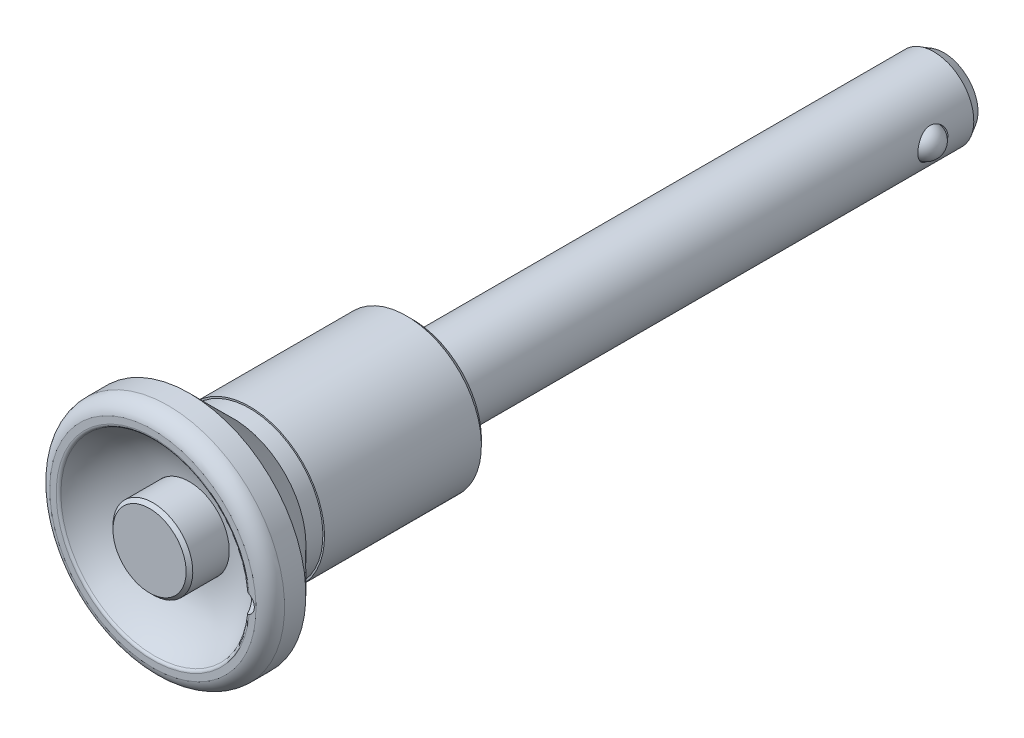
ISO-10303-21;
HEADER;
FILE_DESCRIPTION(('STEP AP214'),'2;1');
FILE_NAME('part.step','',(''),(''),'','','');
FILE_SCHEMA(('AUTOMOTIVE_DESIGN { 1 0 10303 214 1 1 1 1 }'));
ENDSEC;
DATA;
#1=APPLICATION_CONTEXT('core data for automotive mechanical design processes');
#2=APPLICATION_PROTOCOL_DEFINITION('international standard','automotive_design',2000,#1);
#3=PRODUCT_CONTEXT('',#1,'mechanical');
#4=PRODUCT('Part','Part','',(#3));
#5=PRODUCT_RELATED_PRODUCT_CATEGORY('part','',(#4));
#6=PRODUCT_DEFINITION_FORMATION('','',#4);
#7=PRODUCT_DEFINITION_CONTEXT('part definition',#1,'design');
#8=PRODUCT_DEFINITION('design','',#6,#7);
#9=PRODUCT_DEFINITION_SHAPE('','',#8);
#10=(LENGTH_UNIT() NAMED_UNIT(*) SI_UNIT(.MILLI.,.METRE.));
#11=(NAMED_UNIT(*) PLANE_ANGLE_UNIT() SI_UNIT($,.RADIAN.));
#12=(NAMED_UNIT(*) SI_UNIT($,.STERADIAN.) SOLID_ANGLE_UNIT());
#13=UNCERTAINTY_MEASURE_WITH_UNIT(LENGTH_MEASURE(1.E-05),#10,'distance_accuracy_value','');
#14=(GEOMETRIC_REPRESENTATION_CONTEXT(3) GLOBAL_UNCERTAINTY_ASSIGNED_CONTEXT((#13)) GLOBAL_UNIT_ASSIGNED_CONTEXT((#10,
#11,#12)) REPRESENTATION_CONTEXT('',''));
#15=CARTESIAN_POINT('',(0.,0.,0.));
#16=DIRECTION('',(0.,0.,1.));
#17=DIRECTION('',(1.,0.,0.));
#18=AXIS2_PLACEMENT_3D('',#15,#16,#17);
#19=CARTESIAN_POINT('',(0.,0.,-79.9));
#20=DIRECTION('',(0.,0.,-1.));
#21=DIRECTION('',(0.,1.,0.));
#22=AXIS2_PLACEMENT_3D('',#19,#20,#21);
#23=CYLINDRICAL_SURFACE('',#22,6.);
#24=CARTESIAN_POINT('',(-5.56214886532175,2.25,-72.25));
#25=CARTESIAN_POINT('',(-5.5621446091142,2.25000456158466,-72.1284887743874));
#26=CARTESIAN_POINT('',(-5.56617390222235,2.24012396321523,-72.0070076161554));
#27=CARTESIAN_POINT('',(-5.58174238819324,2.20104281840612,-71.7677078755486));
#28=CARTESIAN_POINT('',(-5.59328135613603,2.17184285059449,-71.6498891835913));
#29=CARTESIAN_POINT('',(-5.62238220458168,2.09534486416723,-71.4214369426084));
#30=CARTESIAN_POINT('',(-5.63992964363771,2.04809020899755,-71.3107869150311));
#31=CARTESIAN_POINT('',(-5.67904701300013,1.93697785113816,-71.0989421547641));
#32=CARTESIAN_POINT('',(-5.70061815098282,1.87311516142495,-70.9977502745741));
#33=CARTESIAN_POINT('',(-5.74655362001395,1.72719992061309,-70.802664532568));
#34=CARTESIAN_POINT('',(-5.77100012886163,1.64445571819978,-70.7093072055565));
#35=CARTESIAN_POINT('',(-5.81924625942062,1.46459375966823,-70.5374157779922));
#36=CARTESIAN_POINT('',(-5.84304574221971,1.36747294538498,-70.4588848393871));
#37=CARTESIAN_POINT('',(-5.88829310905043,1.15754198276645,-70.3162907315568));
#38=CARTESIAN_POINT('',(-5.90963341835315,1.04431042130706,-70.2528107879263));
#39=CARTESIAN_POINT('',(-5.94657011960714,0.807833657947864,-70.1460232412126));
#40=CARTESIAN_POINT('',(-5.96216850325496,0.684591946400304,-70.102708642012));
#41=CARTESIAN_POINT('',(-5.98528045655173,0.437234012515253,-70.0393631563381));
#42=CARTESIAN_POINT('',(-5.99311372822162,0.313384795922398,-70.0184085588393));
#43=CARTESIAN_POINT('',(-6.0009602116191,0.0636965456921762,-69.9974181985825));
#44=CARTESIAN_POINT('',(-6.00097596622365,-0.0621418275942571,-69.997375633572));
#45=CARTESIAN_POINT('',(-5.9933889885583,-0.305615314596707,-70.0176726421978));
#46=CARTESIAN_POINT('',(-5.9861631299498,-0.423348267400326,-70.0370039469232));
#47=CARTESIAN_POINT('',(-5.96539912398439,-0.653758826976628,-70.0938038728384));
#48=CARTESIAN_POINT('',(-5.95186052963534,-0.766436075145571,-70.1312737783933));
#49=CARTESIAN_POINT('',(-5.91956653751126,-0.985483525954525,-70.2237556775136));
#50=CARTESIAN_POINT('',(-5.90073809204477,-1.09173808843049,-70.2790150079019));
#51=CARTESIAN_POINT('',(-5.85976965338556,-1.29372991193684,-70.4052881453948));
#52=CARTESIAN_POINT('',(-5.83762859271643,-1.38946376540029,-70.4763070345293));
#53=CARTESIAN_POINT('',(-5.79078794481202,-1.57363573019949,-70.6369409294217));
#54=CARTESIAN_POINT('',(-5.76601445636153,-1.6613192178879,-70.727400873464));
#55=CARTESIAN_POINT('',(-5.71773690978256,-1.82055593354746,-70.921889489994));
#56=CARTESIAN_POINT('',(-5.69423317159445,-1.89210511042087,-71.0259215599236));
#57=CARTESIAN_POINT('',(-5.65069055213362,-2.01848417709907,-71.247579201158));
#58=CARTESIAN_POINT('',(-5.63074015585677,-2.07290771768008,-71.3654552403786));
#59=CARTESIAN_POINT('',(-5.59758657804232,-2.16084696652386,-71.6096443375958));
#60=CARTESIAN_POINT('',(-5.58437964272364,-2.19437430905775,-71.7359526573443));
#61=CARTESIAN_POINT('',(-5.56709395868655,-2.23785287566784,-71.9859639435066));
#62=CARTESIAN_POINT('',(-5.56255177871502,-2.24900281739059,-72.109426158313));
#63=CARTESIAN_POINT('',(-5.56179809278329,-2.25086828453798,-72.3565140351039));
#64=CARTESIAN_POINT('',(-5.56558450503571,-2.24158891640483,-72.4801396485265));
#65=CARTESIAN_POINT('',(-5.58059072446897,-2.20394600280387,-72.7178948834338));
#66=CARTESIAN_POINT('',(-5.59144914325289,-2.17650927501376,-72.8321967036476));
#67=CARTESIAN_POINT('',(-5.61894730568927,-2.10449661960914,-73.0545219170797));
#68=CARTESIAN_POINT('',(-5.63558823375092,-2.05991718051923,-73.162544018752));
#69=CARTESIAN_POINT('',(-5.67354364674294,-1.95300438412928,-73.3737466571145));
#70=CARTESIAN_POINT('',(-5.69500993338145,-1.89006817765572,-73.4765939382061));
#71=CARTESIAN_POINT('',(-5.7399422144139,-1.74886976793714,-73.6706934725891));
#72=CARTESIAN_POINT('',(-5.76340893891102,-1.67060195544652,-73.761941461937));
#73=CARTESIAN_POINT('',(-5.8114956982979,-1.49509101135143,-73.9362525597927));
#74=CARTESIAN_POINT('',(-5.83609454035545,-1.39695951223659,-74.0184301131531));
#75=CARTESIAN_POINT('',(-5.8822481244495,-1.18769620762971,-74.1652575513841));
#76=CARTESIAN_POINT('',(-5.90380285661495,-1.07656435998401,-74.2299073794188));
#77=CARTESIAN_POINT('',(-5.94142478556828,-0.844524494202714,-74.3394190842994));
#78=CARTESIAN_POINT('',(-5.95751072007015,-0.723651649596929,-74.3843486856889));
#79=CARTESIAN_POINT('',(-5.98244155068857,-0.47532283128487,-74.4529846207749));
#80=CARTESIAN_POINT('',(-5.99128984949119,-0.347869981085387,-74.4767009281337));
#81=CARTESIAN_POINT('',(-6.00042610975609,-0.0980033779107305,-74.5011616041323));
#82=CARTESIAN_POINT('',(-6.00118291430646,0.0242711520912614,-74.5031642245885));
#83=CARTESIAN_POINT('',(-5.99527334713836,0.267340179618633,-74.4873772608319));
#84=CARTESIAN_POINT('',(-5.98860787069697,0.388134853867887,-74.4695900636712));
#85=CARTESIAN_POINT('',(-5.96881634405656,0.621822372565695,-74.4156117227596));
#86=CARTESIAN_POINT('',(-5.95585187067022,0.734836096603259,-74.3798801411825));
#87=CARTESIAN_POINT('',(-5.92481675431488,0.953273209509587,-74.2914849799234));
#88=CARTESIAN_POINT('',(-5.90674514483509,1.05869515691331,-74.2388181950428));
#89=CARTESIAN_POINT('',(-5.86635927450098,1.26381026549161,-74.1155290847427));
#90=CARTESIAN_POINT('',(-5.8438986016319,1.36307632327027,-74.0442450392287));
#91=CARTESIAN_POINT('',(-5.79749261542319,1.54862602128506,-73.8867882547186));
#92=CARTESIAN_POINT('',(-5.77354677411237,1.63490500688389,-73.8006102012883));
#93=CARTESIAN_POINT('',(-5.72532194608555,1.7967182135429,-73.6104038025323));
#94=CARTESIAN_POINT('',(-5.70109208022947,1.87144499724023,-73.5056733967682));
#95=CARTESIAN_POINT('',(-5.65647487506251,2.00227064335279,-73.2843761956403));
#96=CARTESIAN_POINT('',(-5.6360879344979,2.05836757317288,-73.1678081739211));
#97=CARTESIAN_POINT('',(-5.60103404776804,2.15198830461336,-72.9205664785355));
#98=CARTESIAN_POINT('',(-5.58665704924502,2.18859004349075,-72.7894984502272));
#99=CARTESIAN_POINT('',(-5.56721991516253,2.23758535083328,-72.5222720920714));
#100=CARTESIAN_POINT('',(-5.56215363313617,2.24999489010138,-72.3861171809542));
#101=CARTESIAN_POINT('',(-5.56214886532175,2.25,-72.25));
#102=B_SPLINE_CURVE_WITH_KNOTS('',3,(#24,#25,#26,#27,#28,#29,#30,#31,#32,#33,#34,#35,#36,#37,
#38,#39,#40,#41,#42,#43,#44,#45,#46,#47,#48,#49,#50,#51,#52,#53,#54,#55,#56,#57,#58,#59,#60,#61,
#62,#63,#64,#65,#66,#67,#68,#69,#70,#71,#72,#73,#74,#75,#76,#77,#78,#79,#80,#81,#82,#83,#84,#85,
#86,#87,#88,#89,#90,#91,#92,#93,#94,#95,#96,#97,#98,#99,#100,#101),.UNSPECIFIED.,.T.,.F.,(4,2,2,
2,2,2,2,2,2,2,2,2,2,2,2,2,2,2,2,2,2,2,2,2,2,2,2,2,2,2,2,2,2,2,2,2,2,2,4),(0.,0.364026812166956,
0.728042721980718,1.09118978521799,1.45444601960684,1.83411978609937,2.2138744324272,
2.60655108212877,2.99909139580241,3.37470027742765,3.75018698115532,4.10709709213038,
4.46403247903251,4.82616196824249,5.18840840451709,5.57185012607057,5.95538801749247,
6.34743888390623,6.73927127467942,7.10948486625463,7.47960593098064,7.83215768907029,
8.18478170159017,8.55062341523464,8.91659922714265,9.30577525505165,9.69495254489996,
10.0827826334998,10.4704302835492,10.8354858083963,11.2004973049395,11.5566041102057,
11.9127783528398,12.2839248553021,12.6552040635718,13.0460789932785,13.4369944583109,
13.8450476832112,14.2528314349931),.UNSPECIFIED.);
#103=CARTESIAN_POINT('',(-5.56214886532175,2.25,-72.25));
#104=VERTEX_POINT('',#103);
#105=EDGE_CURVE('E68',#104,#104,#102,.T.);
#106=ORIENTED_EDGE('',*,*,#105,.T.);
#107=EDGE_LOOP('',(#106));
#108=FACE_BOUND('',#107,.T.);
#109=CARTESIAN_POINT('',(0.,0.,-78.4));
#110=DIRECTION('',(0.,0.,-1.));
#111=DIRECTION('',(0.,1.,0.));
#112=AXIS2_PLACEMENT_3D('',#109,#110,#111);
#113=CIRCLE('',#112,6.);
#114=CARTESIAN_POINT('',(0.,6.,-78.4));
#115=VERTEX_POINT('',#114);
#116=EDGE_CURVE('E314',#115,#115,#113,.T.);
#117=ORIENTED_EDGE('',*,*,#116,.F.);
#118=EDGE_LOOP('',(#117));
#119=FACE_BOUND('',#118,.T.);
#120=CARTESIAN_POINT('',(5.56214886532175,2.25,-72.25));
#121=CARTESIAN_POINT('',(5.5621446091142,2.25000456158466,-72.3715112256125));
#122=CARTESIAN_POINT('',(5.56617390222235,2.24012396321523,-72.4929923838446));
#123=CARTESIAN_POINT('',(5.58174238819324,2.20104281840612,-72.7322921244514));
#124=CARTESIAN_POINT('',(5.59328135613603,2.17184285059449,-72.8501108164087));
#125=CARTESIAN_POINT('',(5.62238220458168,2.09534486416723,-73.0785630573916));
#126=CARTESIAN_POINT('',(5.63992964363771,2.04809020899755,-73.1892130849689));
#127=CARTESIAN_POINT('',(5.67904701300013,1.93697785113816,-73.4010578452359));
#128=CARTESIAN_POINT('',(5.70061815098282,1.87311516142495,-73.5022497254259));
#129=CARTESIAN_POINT('',(5.74655362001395,1.7271999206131,-73.697335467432));
#130=CARTESIAN_POINT('',(5.77100012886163,1.64445571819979,-73.7906927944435));
#131=CARTESIAN_POINT('',(5.81924625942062,1.46459375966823,-73.9625842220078));
#132=CARTESIAN_POINT('',(5.84304574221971,1.36747294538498,-74.0411151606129));
#133=CARTESIAN_POINT('',(5.88829310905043,1.15754198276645,-74.1837092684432));
#134=CARTESIAN_POINT('',(5.90963341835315,1.04431042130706,-74.2471892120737));
#135=CARTESIAN_POINT('',(5.94657011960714,0.807833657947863,-74.3539767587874));
#136=CARTESIAN_POINT('',(5.96216850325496,0.684591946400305,-74.397291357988));
#137=CARTESIAN_POINT('',(5.98528045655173,0.437234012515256,-74.4606368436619));
#138=CARTESIAN_POINT('',(5.99311372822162,0.313384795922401,-74.4815914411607));
#139=CARTESIAN_POINT('',(6.0009602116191,0.0636965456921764,-74.5025818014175));
#140=CARTESIAN_POINT('',(6.00097596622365,-0.0621418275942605,-74.5026243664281));
#141=CARTESIAN_POINT('',(5.9933889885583,-0.305615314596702,-74.4823273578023));
#142=CARTESIAN_POINT('',(5.9861631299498,-0.423348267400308,-74.4629960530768));
#143=CARTESIAN_POINT('',(5.96539912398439,-0.653758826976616,-74.4061961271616));
#144=CARTESIAN_POINT('',(5.95186052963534,-0.766436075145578,-74.3687262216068));
#145=CARTESIAN_POINT('',(5.91956653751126,-0.985483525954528,-74.2762443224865));
#146=CARTESIAN_POINT('',(5.90073809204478,-1.09173808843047,-74.2209849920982));
#147=CARTESIAN_POINT('',(5.85976965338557,-1.29372991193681,-74.0947118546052));
#148=CARTESIAN_POINT('',(5.83762859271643,-1.38946376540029,-74.0236929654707));
#149=CARTESIAN_POINT('',(5.79078794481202,-1.57363573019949,-73.8630590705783));
#150=CARTESIAN_POINT('',(5.76601445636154,-1.66131921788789,-73.772599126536));
#151=CARTESIAN_POINT('',(5.71773690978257,-1.82055593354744,-73.578110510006));
#152=CARTESIAN_POINT('',(5.69423317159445,-1.89210511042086,-73.4740784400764));
#153=CARTESIAN_POINT('',(5.65069055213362,-2.01848417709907,-73.252420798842));
#154=CARTESIAN_POINT('',(5.63074015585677,-2.07290771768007,-73.1345447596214));
#155=CARTESIAN_POINT('',(5.59758657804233,-2.16084696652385,-72.8903556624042));
#156=CARTESIAN_POINT('',(5.58437964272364,-2.19437430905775,-72.7640473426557));
#157=CARTESIAN_POINT('',(5.56709395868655,-2.23785287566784,-72.5140360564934));
#158=CARTESIAN_POINT('',(5.56255177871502,-2.24900281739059,-72.3905738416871));
#159=CARTESIAN_POINT('',(5.56179809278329,-2.25086828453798,-72.1434859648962));
#160=CARTESIAN_POINT('',(5.56558450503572,-2.24158891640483,-72.0198603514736));
#161=CARTESIAN_POINT('',(5.58059072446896,-2.20394600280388,-71.7821051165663));
#162=CARTESIAN_POINT('',(5.59144914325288,-2.17650927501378,-71.6678032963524));
#163=CARTESIAN_POINT('',(5.61894730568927,-2.10449661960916,-71.4454780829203));
#164=CARTESIAN_POINT('',(5.63558823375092,-2.05991718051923,-71.337455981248));
#165=CARTESIAN_POINT('',(5.67354364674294,-1.95300438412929,-71.1262533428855));
#166=CARTESIAN_POINT('',(5.69500993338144,-1.89006817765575,-71.0234060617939));
#167=CARTESIAN_POINT('',(5.73994221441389,-1.74886976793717,-70.829306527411));
#168=CARTESIAN_POINT('',(5.76340893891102,-1.67060195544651,-70.7380585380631));
#169=CARTESIAN_POINT('',(5.8114956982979,-1.49509101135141,-70.5637474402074));
#170=CARTESIAN_POINT('',(5.83609454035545,-1.3969595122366,-70.4815698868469));
#171=CARTESIAN_POINT('',(5.88224812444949,-1.18769620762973,-70.3347424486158));
#172=CARTESIAN_POINT('',(5.90380285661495,-1.07656435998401,-70.2700926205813));
#173=CARTESIAN_POINT('',(5.94142478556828,-0.844524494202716,-70.1605809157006));
#174=CARTESIAN_POINT('',(5.95751072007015,-0.723651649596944,-70.1156513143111));
#175=CARTESIAN_POINT('',(5.98244155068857,-0.475322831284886,-70.0470153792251));
#176=CARTESIAN_POINT('',(5.99128984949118,-0.347869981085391,-70.0232990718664));
#177=CARTESIAN_POINT('',(6.0004261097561,-0.0980033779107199,-69.9988383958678));
#178=CARTESIAN_POINT('',(6.00118291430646,0.0242711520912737,-69.9968357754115));
#179=CARTESIAN_POINT('',(5.99527334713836,0.267340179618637,-70.0126227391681));
#180=CARTESIAN_POINT('',(5.98860787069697,0.388134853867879,-70.0304099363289));
#181=CARTESIAN_POINT('',(5.96881634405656,0.621822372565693,-70.0843882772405));
#182=CARTESIAN_POINT('',(5.95585187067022,0.734836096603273,-70.1201198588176));
#183=CARTESIAN_POINT('',(5.92481675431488,0.953273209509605,-70.2085150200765));
#184=CARTESIAN_POINT('',(5.90674514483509,1.05869515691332,-70.2611818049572));
#185=CARTESIAN_POINT('',(5.86635927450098,1.2638102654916,-70.3844709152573));
#186=CARTESIAN_POINT('',(5.8438986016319,1.36307632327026,-70.4557549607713));
#187=CARTESIAN_POINT('',(5.79749261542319,1.54862602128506,-70.6132117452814));
#188=CARTESIAN_POINT('',(5.77354677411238,1.63490500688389,-70.6993897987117));
#189=CARTESIAN_POINT('',(5.72532194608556,1.7967182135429,-70.8895961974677));
#190=CARTESIAN_POINT('',(5.70109208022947,1.87144499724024,-70.9943266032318));
#191=CARTESIAN_POINT('',(5.6564748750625,2.00227064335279,-71.2156238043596));
#192=CARTESIAN_POINT('',(5.63608793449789,2.05836757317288,-71.3321918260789));
#193=CARTESIAN_POINT('',(5.60103404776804,2.15198830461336,-71.5794335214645));
#194=CARTESIAN_POINT('',(5.58665704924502,2.18859004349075,-71.7105015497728));
#195=CARTESIAN_POINT('',(5.56721991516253,2.23758535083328,-71.9777279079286));
#196=CARTESIAN_POINT('',(5.56215363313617,2.24999489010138,-72.1138828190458));
#197=CARTESIAN_POINT('',(5.56214886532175,2.25,-72.25));
#198=B_SPLINE_CURVE_WITH_KNOTS('',3,(#120,#121,#122,#123,#124,#125,#126,#127,#128,#129,#130,
#131,#132,#133,#134,#135,#136,#137,#138,#139,#140,#141,#142,#143,#144,#145,#146,#147,#148,#149,
#150,#151,#152,#153,#154,#155,#156,#157,#158,#159,#160,#161,#162,#163,#164,#165,#166,#167,#168,
#169,#170,#171,#172,#173,#174,#175,#176,#177,#178,#179,#180,#181,#182,#183,#184,#185,#186,#187,
#188,#189,#190,#191,#192,#193,#194,#195,#196,#197),.UNSPECIFIED.,.T.,.F.,(4,2,2,2,2,2,2,2,2,2,2,
2,2,2,2,2,2,2,2,2,2,2,2,2,2,2,2,2,2,2,2,2,2,2,2,2,2,2,4),(0.,0.364026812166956,
0.728042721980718,1.09118978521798,1.45444601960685,1.83411978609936,2.2138744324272,
2.60655108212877,2.99909139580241,3.37470027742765,3.75018698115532,4.10709709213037,
4.46403247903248,4.82616196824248,5.18840840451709,5.57185012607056,5.95538801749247,
6.34743888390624,6.73927127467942,7.10948486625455,7.47960593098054,7.83215768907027,
8.18478170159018,8.55062341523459,8.91659922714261,9.30577525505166,9.69495254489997,
10.0827826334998,10.4704302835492,10.8354858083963,11.2004973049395,11.5566041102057,
11.9127783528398,12.2839248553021,12.6552040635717,13.0460789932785,13.4369944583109,
13.8450476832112,14.2528314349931),.UNSPECIFIED.);
#199=CARTESIAN_POINT('',(5.56214886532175,2.25,-72.25));
#200=VERTEX_POINT('',#199);
#201=EDGE_CURVE('E292',#200,#200,#198,.T.);
#202=ORIENTED_EDGE('',*,*,#201,.T.);
#203=EDGE_LOOP('',(#202));
#204=FACE_BOUND('',#203,.T.);
#205=CARTESIAN_POINT('',(0.,0.,0.));
#206=DIRECTION('',(0.,0.,1.));
#207=DIRECTION('',(1.,0.,0.));
#208=AXIS2_PLACEMENT_3D('',#205,#206,#207);
#209=CIRCLE('',#208,6.);
#210=CARTESIAN_POINT('',(6.,0.,0.));
#211=VERTEX_POINT('',#210);
#212=EDGE_CURVE('E80',#211,#211,#209,.T.);
#213=ORIENTED_EDGE('',*,*,#212,.F.);
#214=EDGE_LOOP('',(#213));
#215=FACE_BOUND('',#214,.T.);
#216=ADVANCED_FACE('F14',(#108,#119,#204,#215),#23,.T.);
#217=CARTESIAN_POINT('',(0.,0.,-79.9));
#218=DIRECTION('',(0.,0.,-1.));
#219=DIRECTION('',(0.,1.,0.));
#220=AXIS2_PLACEMENT_3D('',#217,#218,#219);
#221=CYLINDRICAL_SURFACE('',#220,2.75);
#222=CARTESIAN_POINT('',(0.,0.,-74.5));
#223=DIRECTION('',(0.,0.,-1.));
#224=DIRECTION('',(0.,1.,0.));
#225=AXIS2_PLACEMENT_3D('',#222,#223,#224);
#226=CIRCLE('',#225,2.75);
#227=CARTESIAN_POINT('',(0.,2.75,-74.5));
#228=VERTEX_POINT('',#227);
#229=EDGE_CURVE('E74',#228,#228,#226,.T.);
#230=ORIENTED_EDGE('',*,*,#229,.F.);
#231=EDGE_LOOP('',(#230));
#232=FACE_BOUND('',#231,.T.);
#233=CARTESIAN_POINT('',(0.,0.,-79.9));
#234=DIRECTION('',(0.,0.,-1.));
#235=DIRECTION('',(0.,1.,0.));
#236=AXIS2_PLACEMENT_3D('',#233,#234,#235);
#237=CIRCLE('',#236,2.75);
#238=CARTESIAN_POINT('',(0.,2.75,-79.9));
#239=VERTEX_POINT('',#238);
#240=EDGE_CURVE('E306',#239,#239,#237,.T.);
#241=ORIENTED_EDGE('',*,*,#240,.T.);
#242=EDGE_LOOP('',(#241));
#243=FACE_BOUND('',#242,.T.);
#244=ADVANCED_FACE('F273',(#232,#243),#221,.F.);
#245=CARTESIAN_POINT('',(2.75,0.,-79.9));
#246=DIRECTION('',(0.,0.,-1.));
#247=DIRECTION('',(0.,1.,0.));
#248=AXIS2_PLACEMENT_3D('',#245,#246,#247);
#249=PLANE('',#248);
#250=CARTESIAN_POINT('',(0.,0.,-79.9));
#251=DIRECTION('',(0.,0.,-1.));
#252=DIRECTION('',(0.,1.,0.));
#253=AXIS2_PLACEMENT_3D('',#250,#251,#252);
#254=CIRCLE('',#253,5.13397459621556);
#255=CARTESIAN_POINT('',(0.,5.13397459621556,-79.9));
#256=VERTEX_POINT('',#255);
#257=EDGE_CURVE('E310',#256,#256,#254,.T.);
#258=ORIENTED_EDGE('',*,*,#257,.T.);
#259=EDGE_LOOP('',(#258));
#260=FACE_BOUND('',#259,.T.);
#261=ORIENTED_EDGE('',*,*,#240,.F.);
#262=EDGE_LOOP('',(#261));
#263=FACE_BOUND('',#262,.T.);
#264=ADVANCED_FACE('F280',(#260,#263),#249,.T.);
#265=CARTESIAN_POINT('',(0.,0.,-79.9));
#266=DIRECTION('',(0.,0.,1.));
#267=DIRECTION('',(0.,-1.,0.));
#268=AXIS2_PLACEMENT_3D('',#265,#266,#267);
#269=CONICAL_SURFACE('',#268,5.13397459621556,0.523598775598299);
#270=ORIENTED_EDGE('',*,*,#116,.T.);
#271=EDGE_LOOP('',(#270));
#272=FACE_BOUND('',#271,.T.);
#273=ORIENTED_EDGE('',*,*,#257,.F.);
#274=EDGE_LOOP('',(#273));
#275=FACE_BOUND('',#274,.T.);
#276=ADVANCED_FACE('F288',(#272,#275),#269,.T.);
#277=CARTESIAN_POINT('',(7.,0.,-72.25));
#278=DIRECTION('',(1.,0.,0.));
#279=DIRECTION('',(0.,1.,0.));
#280=AXIS2_PLACEMENT_3D('',#277,#278,#279);
#281=CYLINDRICAL_SURFACE('',#280,2.25);
#282=CARTESIAN_POINT('',(4.70120856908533,2.25,-72.25));
#283=CARTESIAN_POINT('',(4.70121469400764,2.24999417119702,-72.1304590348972));
#284=CARTESIAN_POINT('',(4.70583400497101,2.24041261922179,-72.0107125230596));
#285=CARTESIAN_POINT('',(4.72369711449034,2.20249080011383,-71.7747180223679));
#286=CARTESIAN_POINT('',(4.73696351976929,2.17410135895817,-71.6584800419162));
#287=CARTESIAN_POINT('',(4.77031963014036,2.09989154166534,-71.4333349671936));
#288=CARTESIAN_POINT('',(4.79038009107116,2.05414577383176,-71.324398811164));
#289=CARTESIAN_POINT('',(4.83501981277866,1.94674472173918,-71.1157771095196));
#290=CARTESIAN_POINT('',(4.85959823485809,1.88509238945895,-71.016089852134));
#291=CARTESIAN_POINT('',(4.91234222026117,1.74321937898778,-70.8220680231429));
#292=CARTESIAN_POINT('',(4.94063496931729,1.66209866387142,-70.7284258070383));
#293=CARTESIAN_POINT('',(4.99657815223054,1.48547872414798,-70.5555585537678));
#294=CARTESIAN_POINT('',(5.02422832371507,1.38997374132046,-70.4763393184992));
#295=CARTESIAN_POINT('',(5.07733633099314,1.18176930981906,-70.3309420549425));
#296=CARTESIAN_POINT('',(5.10262925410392,1.06847133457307,-70.2655553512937));
#297=CARTESIAN_POINT('',(5.14660113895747,0.831192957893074,-70.1550726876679));
#298=CARTESIAN_POINT('',(5.16528324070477,0.707217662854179,-70.1099670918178));
#299=CARTESIAN_POINT('',(5.1930243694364,0.459385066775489,-70.0438746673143));
#300=CARTESIAN_POINT('',(5.20255899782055,0.335901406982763,-70.021690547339));
#301=CARTESIAN_POINT('',(5.21266651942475,0.0866213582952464,-69.9981895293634));
#302=CARTESIAN_POINT('',(5.21324333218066,-0.0391739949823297,-69.9968635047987));
#303=CARTESIAN_POINT('',(5.20564133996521,-0.280752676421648,-70.0145162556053));
#304=CARTESIAN_POINT('',(5.19803132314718,-0.396653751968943,-70.0321759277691));
#305=CARTESIAN_POINT('',(5.17570524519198,-0.623658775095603,-70.0850210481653));
#306=CARTESIAN_POINT('',(5.16098865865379,-0.73476236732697,-70.1202077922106));
#307=CARTESIAN_POINT('',(5.12557562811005,-0.951074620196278,-70.2075078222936));
#308=CARTESIAN_POINT('',(5.10479112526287,-1.05616705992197,-70.2598718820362));
#309=CARTESIAN_POINT('',(5.05924909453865,-1.25634985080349,-70.3797828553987));
#310=CARTESIAN_POINT('',(5.03449013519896,-1.35143657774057,-70.4473352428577));
#311=CARTESIAN_POINT('',(4.9812692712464,-1.53647964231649,-70.6015757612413));
#312=CARTESIAN_POINT('',(4.95266891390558,-1.62551877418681,-70.689317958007));
#313=CARTESIAN_POINT('',(4.89634671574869,-1.7880335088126,-70.8785052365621));
#314=CARTESIAN_POINT('',(4.8686252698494,-1.86150219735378,-70.9799563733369));
#315=CARTESIAN_POINT('',(4.81616806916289,-1.99339518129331,-71.1984520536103));
#316=CARTESIAN_POINT('',(4.79158303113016,-2.05115292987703,-71.3159383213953));
#317=CARTESIAN_POINT('',(4.75001097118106,-2.14568300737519,-71.5603104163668));
#318=CARTESIAN_POINT('',(4.73301805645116,-2.18247161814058,-71.6871888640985));
#319=CARTESIAN_POINT('',(4.7100473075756,-2.23159308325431,-71.9375319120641));
#320=CARTESIAN_POINT('',(4.70339790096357,-2.24542132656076,-72.0606401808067));
#321=CARTESIAN_POINT('',(4.69994279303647,-2.25264846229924,-72.3075714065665));
#322=CARTESIAN_POINT('',(4.70313324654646,-2.24605533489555,-72.4313940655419));
#323=CARTESIAN_POINT('',(4.71830050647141,-2.21399394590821,-72.6669653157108));
#324=CARTESIAN_POINT('',(4.72963794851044,-2.18989787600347,-72.778947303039));
#325=CARTESIAN_POINT('',(4.75898261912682,-2.1253689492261,-72.9971687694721));
#326=CARTESIAN_POINT('',(4.77699148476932,-2.08493208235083,-73.1034068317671));
#327=CARTESIAN_POINT('',(4.81860535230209,-1.98691927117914,-73.3123309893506));
#328=CARTESIAN_POINT('',(4.84242072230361,-1.92867086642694,-73.414658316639));
#329=CARTESIAN_POINT('',(4.89268495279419,-1.79734114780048,-73.608600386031));
#330=CARTESIAN_POINT('',(4.91913500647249,-1.72425309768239,-73.7002102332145));
#331=CARTESIAN_POINT('',(4.97451487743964,-1.55769648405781,-73.8785741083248));
#332=CARTESIAN_POINT('',(5.00345675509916,-1.46299589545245,-73.9641786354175));
#333=CARTESIAN_POINT('',(5.05840859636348,-1.25992784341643,-74.11851397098));
#334=CARTESIAN_POINT('',(5.0844182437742,-1.15155890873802,-74.1872429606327));
#335=CARTESIAN_POINT('',(5.13083610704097,-0.923055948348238,-74.3059980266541));
#336=CARTESIAN_POINT('',(5.15121223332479,-0.802859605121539,-74.3559175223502));
#337=CARTESIAN_POINT('',(5.18380508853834,-0.554662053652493,-74.4344361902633));
#338=CARTESIAN_POINT('',(5.19602706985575,-0.426665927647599,-74.4630490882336));
#339=CARTESIAN_POINT('',(5.21029045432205,-0.176736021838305,-74.4963229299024));
#340=CARTESIAN_POINT('',(5.21301888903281,-0.0550554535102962,-74.5026010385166));
#341=CARTESIAN_POINT('',(5.20993078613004,0.187600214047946,-74.495446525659));
#342=CARTESIAN_POINT('',(5.2041159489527,0.308575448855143,-74.4820178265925));
#343=CARTESIAN_POINT('',(5.18496872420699,0.541359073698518,-74.436990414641));
#344=CARTESIAN_POINT('',(5.17194743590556,0.65334050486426,-74.4061426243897));
#345=CARTESIAN_POINT('',(5.13986314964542,0.870473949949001,-74.3280030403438));
#346=CARTESIAN_POINT('',(5.12079904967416,0.975624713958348,-74.2807082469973));
#347=CARTESIAN_POINT('',(5.07736891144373,1.18141977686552,-74.1686191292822));
#348=CARTESIAN_POINT('',(5.05280038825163,1.28163851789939,-74.1031238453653));
#349=CARTESIAN_POINT('',(5.00122306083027,1.47009921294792,-73.957485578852));
#350=CARTESIAN_POINT('',(4.9742132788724,1.5583363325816,-73.877336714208));
#351=CARTESIAN_POINT('',(4.9182708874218,1.72712341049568,-73.6976966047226));
#352=CARTESIAN_POINT('',(4.88934356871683,1.80662459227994,-73.5972140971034));
#353=CARTESIAN_POINT('',(4.83482876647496,1.94782882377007,-73.3835276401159));
#354=CARTESIAN_POINT('',(4.80924325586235,2.00952138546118,-73.270316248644));
#355=CARTESIAN_POINT('',(4.76470338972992,2.11297708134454,-73.0338474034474));
#356=CARTESIAN_POINT('',(4.74574393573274,2.15475554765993,-72.9105977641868));
#357=CARTESIAN_POINT('',(4.72435108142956,2.20105394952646,-72.7212685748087));
#358=CARTESIAN_POINT('',(4.71839681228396,2.21375426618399,-72.6574783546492));
#359=CARTESIAN_POINT('',(4.70903769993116,2.23359624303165,-72.5288695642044));
#360=CARTESIAN_POINT('',(4.70563091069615,2.2407421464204,-72.4640518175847));
#361=CARTESIAN_POINT('',(4.7027842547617,2.24670526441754,-72.3742341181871));
#362=CARTESIAN_POINT('',(4.7021941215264,2.24794009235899,-72.3494079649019));
#363=CARTESIAN_POINT('',(4.70140563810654,2.24958807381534,-72.299724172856));
#364=CARTESIAN_POINT('',(4.70120729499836,2.25000121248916,-72.2748665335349));
#365=CARTESIAN_POINT('',(4.70120856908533,2.25,-72.25));
#366=B_SPLINE_CURVE_WITH_KNOTS('',3,(#282,#283,#284,#285,#286,#287,#288,#289,#290,#291,#292,
#293,#294,#295,#296,#297,#298,#299,#300,#301,#302,#303,#304,#305,#306,#307,#308,#309,#310,#311,
#312,#313,#314,#315,#316,#317,#318,#319,#320,#321,#322,#323,#324,#325,#326,#327,#328,#329,#330,
#331,#332,#333,#334,#335,#336,#337,#338,#339,#340,#341,#342,#343,#344,#345,#346,#347,#348,#349,
#350,#351,#352,#353,#354,#355,#356,#357,#358,#359,#360,#361,#362,#363,#364,#365),.UNSPECIFIED.,
.T.,.F.,(4,2,2,2,2,2,2,2,2,2,2,2,2,2,2,2,2,2,2,2,2,2,2,2,2,2,2,2,2,2,2,2,2,2,2,2,2,2,2,2,2,4),
(0.,0.358523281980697,0.717987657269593,1.07592402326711,1.43379401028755,1.81338979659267,
2.19313794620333,2.59079710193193,2.98826712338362,3.36372670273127,3.73902199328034,
4.08983186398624,4.44066767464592,4.79687203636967,5.15320497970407,5.53621810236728,
5.91940095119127,6.31693575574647,6.71416146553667,7.08432459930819,7.45434310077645,
7.79811230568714,8.14196592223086,8.50086375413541,8.85992486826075,9.25080120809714,
9.64171965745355,10.0348210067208,10.427668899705,10.7914180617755,11.1550948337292,
11.5041747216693,11.8533183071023,12.2184179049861,12.583664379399,12.9758816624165,
13.3683294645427,13.7604746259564,13.9561801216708,14.1517359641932,14.2263134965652,
14.3008923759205),.UNSPECIFIED.);
#367=CARTESIAN_POINT('',(4.84677342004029,1.91641577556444,-73.4289192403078));
#368=VERTEX_POINT('',#367);
#369=CARTESIAN_POINT('',(4.84677342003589,-1.91641577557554,-73.4289192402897));
#370=VERTEX_POINT('',#369);
#371=EDGE_CURVE('E70',#368,#370,#366,.T.);
#372=ORIENTED_EDGE('',*,*,#371,.F.);
#373=CARTESIAN_POINT('',(5.21189620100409,0.,-74.5));
#374=CARTESIAN_POINT('',(5.21189615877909,0.126284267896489,-74.4999948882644));
#375=CARTESIAN_POINT('',(5.21139467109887,0.252644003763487,-74.4893340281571));
#376=CARTESIAN_POINT('',(5.20938058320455,0.501864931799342,-74.4469613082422));
#377=CARTESIAN_POINT('',(5.20786696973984,0.624722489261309,-74.4152283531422));
#378=CARTESIAN_POINT('',(5.20380519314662,0.863320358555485,-74.3316208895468));
#379=CARTESIAN_POINT('',(5.20125743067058,0.97906340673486,-74.2797541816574));
#380=CARTESIAN_POINT('',(5.19508229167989,1.20015943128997,-74.1573752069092));
#381=CARTESIAN_POINT('',(5.19145518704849,1.30551501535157,-74.0868676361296));
#382=CARTESIAN_POINT('',(5.18303472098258,1.50291352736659,-73.9291996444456));
#383=CARTESIAN_POINT('',(5.17824107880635,1.59495324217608,-73.8420352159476));
#384=CARTESIAN_POINT('',(5.1673344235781,1.76311423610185,-73.653525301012));
#385=CARTESIAN_POINT('',(5.1612210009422,1.83923055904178,-73.5521754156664));
#386=CARTESIAN_POINT('',(5.14734400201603,1.97343552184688,-73.3381336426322));
#387=CARTESIAN_POINT('',(5.13957863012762,2.03150437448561,-73.2254294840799));
#388=CARTESIAN_POINT('',(5.1217672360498,2.1278284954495,-72.9921124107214));
#389=CARTESIAN_POINT('',(5.11172400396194,2.1661078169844,-72.8715092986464));
#390=CARTESIAN_POINT('',(5.09330546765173,2.2077406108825,-72.6884429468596));
#391=CARTESIAN_POINT('',(5.08666779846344,2.21896106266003,-72.6275162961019));
#392=CARTESIAN_POINT('',(5.07117135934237,2.23631965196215,-72.505313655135));
#393=CARTESIAN_POINT('',(5.06231462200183,2.24246241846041,-72.4440380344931));
#394=CARTESIAN_POINT('',(5.04473959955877,2.24786649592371,-72.3524947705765));
#395=CARTESIAN_POINT('',(5.03817832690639,2.24903385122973,-72.3220839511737));
#396=CARTESIAN_POINT('',(5.02487846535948,2.24972982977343,-72.2856268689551));
#397=CARTESIAN_POINT('',(5.02196282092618,2.24983087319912,-72.2784116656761));
#398=CARTESIAN_POINT('',(5.01679668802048,2.24992122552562,-72.2690075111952));
#399=CARTESIAN_POINT('',(5.01524668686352,2.24994100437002,-72.266465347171));
#400=CARTESIAN_POINT('',(5.01258312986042,2.24996347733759,-72.2628773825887));
#401=CARTESIAN_POINT('',(5.01163231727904,2.24996978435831,-72.2617128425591));
#402=CARTESIAN_POINT('',(5.0095747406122,2.24998007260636,-72.2595306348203));
#403=CARTESIAN_POINT('',(5.00846878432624,2.24998406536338,-72.2585122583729));
#404=CARTESIAN_POINT('',(5.0067156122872,2.2499883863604,-72.2572404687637));
#405=CARTESIAN_POINT('',(5.00615104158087,2.2499895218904,-72.2568745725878));
#406=CARTESIAN_POINT('',(5.00497729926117,2.2499914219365,-72.2562214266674));
#407=CARTESIAN_POINT('',(5.00436814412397,2.24999218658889,-72.255934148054));
#408=CARTESIAN_POINT('',(5.00310140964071,2.24999338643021,-72.2554607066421));
#409=CARTESIAN_POINT('',(5.00244330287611,2.24999381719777,-72.2552759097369));
#410=CARTESIAN_POINT('',(5.0011038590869,2.24999436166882,-72.2550386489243));
#411=CARTESIAN_POINT('',(5.00042256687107,2.24999447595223,-72.2549859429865));
#412=CARTESIAN_POINT('',(4.99914424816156,2.24999440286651,-72.2550185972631));
#413=CARTESIAN_POINT('',(4.99854676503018,2.24999424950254,-72.2550883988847));
#414=CARTESIAN_POINT('',(4.99737209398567,2.24999369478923,-72.2553279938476));
#415=CARTESIAN_POINT('',(4.99679493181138,2.24999329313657,-72.2554979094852));
#416=CARTESIAN_POINT('',(4.99546550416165,2.24999202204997,-72.255998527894));
#417=CARTESIAN_POINT('',(4.99472705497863,2.24999103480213,-72.2563654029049));
#418=CARTESIAN_POINT('',(4.9933161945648,2.24998849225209,-72.2572086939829));
#419=CARTESIAN_POINT('',(4.99264394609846,2.24998693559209,-72.257685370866));
#420=CARTESIAN_POINT('',(4.99079786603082,2.24998155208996,-72.2591607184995));
#421=CARTESIAN_POINT('',(4.98969889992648,2.24997693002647,-72.2602516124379));
#422=CARTESIAN_POINT('',(4.98765562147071,2.24996520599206,-72.2625688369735));
#423=CARTESIAN_POINT('',(4.9867118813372,2.249958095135,-72.2637956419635));
#424=CARTESIAN_POINT('',(4.98193653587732,2.2499128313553,-72.2705312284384));
#425=CARTESIAN_POINT('',(4.97899990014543,2.24985038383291,-72.2766418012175));
#426=CARTESIAN_POINT('',(4.97376920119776,2.24966896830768,-72.2891278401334));
#427=CARTESIAN_POINT('',(4.97148201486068,2.24954942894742,-72.2955053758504));
#428=CARTESIAN_POINT('',(4.9610614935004,2.24881762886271,-72.327105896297));
#429=CARTESIAN_POINT('',(4.95530816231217,2.24778447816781,-72.3531043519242));
#430=CARTESIAN_POINT('',(4.94501184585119,2.24479018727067,-72.4053004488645));
#431=CARTESIAN_POINT('',(4.9404752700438,2.24282427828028,-72.4314984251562));
#432=CARTESIAN_POINT('',(4.92798476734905,2.23550007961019,-72.5104298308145));
#433=CARTESIAN_POINT('',(4.92120435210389,2.22872063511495,-72.5632520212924));
#434=CARTESIAN_POINT('',(4.90891131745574,2.21142389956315,-72.6682645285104));
#435=CARTESIAN_POINT('',(4.90339617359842,2.20091415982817,-72.7204559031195));
#436=CARTESIAN_POINT('',(4.88803764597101,2.16373012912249,-72.8762327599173));
#437=CARTESIAN_POINT('',(4.87942579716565,2.13143364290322,-72.9786677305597));
#438=CARTESIAN_POINT('',(4.86395279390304,2.05263870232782,-73.1776953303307));
#439=CARTESIAN_POINT('',(4.85708717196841,2.00617717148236,-73.2743023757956));
#440=CARTESIAN_POINT('',(4.84463430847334,1.89998698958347,-73.4599495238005));
#441=CARTESIAN_POINT('',(4.83904642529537,1.84026502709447,-73.5489934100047));
#442=CARTESIAN_POINT('',(4.82796886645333,1.69683921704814,-73.7329593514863));
#443=CARTESIAN_POINT('',(4.82267830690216,1.61075316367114,-73.8260495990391));
#444=CARTESIAN_POINT('',(4.81331124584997,1.42411005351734,-73.9965405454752));
#445=CARTESIAN_POINT('',(4.80923548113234,1.32354426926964,-74.0739317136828));
#446=CARTESIAN_POINT('',(4.80219403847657,1.11084101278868,-74.2107437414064));
#447=CARTESIAN_POINT('',(4.79922814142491,0.998705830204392,-74.270168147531));
#448=CARTESIAN_POINT('',(4.79434733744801,0.766047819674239,-74.3693541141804));
#449=CARTESIAN_POINT('',(4.7924323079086,0.645525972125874,-74.4091179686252));
#450=CARTESIAN_POINT('',(4.78962227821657,0.399571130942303,-74.4678412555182));
#451=CARTESIAN_POINT('',(4.78872674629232,0.274140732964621,-74.4868115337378));
#452=CARTESIAN_POINT('',(4.7879410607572,0.0218703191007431,-74.5034420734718));
#453=CARTESIAN_POINT('',(4.78805091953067,-0.104969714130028,-74.5011020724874));
#454=CARTESIAN_POINT('',(4.78927737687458,-0.356418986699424,-74.4751821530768));
#455=CARTESIAN_POINT('',(4.79039368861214,-0.481028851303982,-74.4516082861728));
#456=CARTESIAN_POINT('',(4.79364906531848,-0.724519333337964,-74.3839024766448));
#457=CARTESIAN_POINT('',(4.79578813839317,-0.843399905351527,-74.339770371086));
#458=CARTESIAN_POINT('',(4.80112512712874,-1.07207309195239,-74.2322025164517));
#459=CARTESIAN_POINT('',(4.80432317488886,-1.18186457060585,-74.1687643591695));
#460=CARTESIAN_POINT('',(4.81184515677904,-1.3892259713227,-74.0244041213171));
#461=CARTESIAN_POINT('',(4.81616903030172,-1.48679655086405,-73.9434829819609));
#462=CARTESIAN_POINT('',(4.82606445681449,-1.66699500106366,-73.7664389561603));
#463=CARTESIAN_POINT('',(4.83163644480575,-1.74961764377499,-73.6703107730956));
#464=CARTESIAN_POINT('',(4.84427017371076,-1.89756793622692,-73.465602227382));
#465=CARTESIAN_POINT('',(4.85133233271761,-1.96289072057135,-73.3570183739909));
#466=CARTESIAN_POINT('',(4.86742332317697,-2.07443577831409,-73.1304409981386));
#467=CARTESIAN_POINT('',(4.87645418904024,-2.12063814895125,-73.0124378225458));
#468=CARTESIAN_POINT('',(4.89787609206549,-2.19253624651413,-72.7707327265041));
#469=CARTESIAN_POINT('',(4.9102638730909,-2.2182517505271,-72.6470364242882));
#470=CARTESIAN_POINT('',(4.93489152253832,-2.24079197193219,-72.4621887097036));
#471=CARTESIAN_POINT('',(4.94392093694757,-2.24567525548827,-72.4016395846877));
#472=CARTESIAN_POINT('',(4.96144377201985,-2.24865520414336,-72.3288938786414));
#473=CARTESIAN_POINT('',(4.96488235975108,-2.24907569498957,-72.3157504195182));
#474=CARTESIAN_POINT('',(4.97117438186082,-2.24953233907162,-72.2963421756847));
#475=CARTESIAN_POINT('',(4.97347535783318,-2.24965571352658,-72.2898919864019));
#476=CARTESIAN_POINT('',(4.97872381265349,-2.2498436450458,-72.277231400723));
#477=CARTESIAN_POINT('',(4.98166680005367,-2.24990859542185,-72.2710196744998));
#478=CARTESIAN_POINT('',(4.98649447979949,-2.24995636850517,-72.264083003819));
#479=CARTESIAN_POINT('',(4.98748893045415,-2.24996411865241,-72.2627698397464));
#480=CARTESIAN_POINT('',(4.98964936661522,-2.24997676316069,-72.2602966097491));
#481=CARTESIAN_POINT('',(4.99081420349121,-2.24998167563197,-72.2591356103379));
#482=CARTESIAN_POINT('',(4.99264559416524,-2.24998690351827,-72.2576897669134));
#483=CARTESIAN_POINT('',(4.9932154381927,-2.24998824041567,-72.2572839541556));
#484=CARTESIAN_POINT('',(4.99440370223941,-2.24999050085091,-72.2565481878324));
#485=CARTESIAN_POINT('',(4.99502214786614,-2.24999142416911,-72.2562182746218));
#486=CARTESIAN_POINT('',(4.99631433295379,-2.24999290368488,-72.2556581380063));
#487=CARTESIAN_POINT('',(4.99698872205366,-2.24999345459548,-72.2554293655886));
#488=CARTESIAN_POINT('',(4.99836895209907,-2.24999420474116,-72.2551094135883));
#489=CARTESIAN_POINT('',(4.99907470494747,-2.24999440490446,-72.2550178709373));
#490=CARTESIAN_POINT('',(5.00040115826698,-2.24999446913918,-72.2549888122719));
#491=CARTESIAN_POINT('',(5.00102150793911,-2.24999437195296,-72.2550335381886));
#492=CARTESIAN_POINT('',(5.00224443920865,-2.24999391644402,-72.2552331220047));
#493=CARTESIAN_POINT('',(5.00284699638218,-2.24999355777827,-72.2553881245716));
#494=CARTESIAN_POINT('',(5.00417868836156,-2.24999242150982,-72.255845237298));
#495=CARTESIAN_POINT('',(5.00489786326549,-2.24999155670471,-72.2561758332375));
#496=CARTESIAN_POINT('',(5.00627531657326,-2.24998931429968,-72.2569451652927));
#497=CARTESIAN_POINT('',(5.0069334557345,-2.24998793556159,-72.2573841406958));
#498=CARTESIAN_POINT('',(5.00870837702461,-2.24998324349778,-72.2587256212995));
#499=CARTESIAN_POINT('',(5.00975965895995,-2.24997927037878,-72.2597134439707));
#500=CARTESIAN_POINT('',(5.01171957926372,-2.24996920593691,-72.2618205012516));
#501=CARTESIAN_POINT('',(5.01262772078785,-2.24996310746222,-72.2629401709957));
#502=CARTESIAN_POINT('',(5.01640763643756,-2.2499311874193,-72.2680200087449));
#503=CARTESIAN_POINT('',(5.01876364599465,-2.24989314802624,-72.2723506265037));
#504=CARTESIAN_POINT('',(5.02299212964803,-2.24978775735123,-72.2812382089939));
#505=CARTESIAN_POINT('',(5.02486105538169,-2.24972020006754,-72.2857965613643));
#506=CARTESIAN_POINT('',(5.03489036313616,-2.24924415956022,-72.3122210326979));
#507=CARTESIAN_POINT('',(5.04042841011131,-2.24850580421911,-72.3350346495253));
#508=CARTESIAN_POINT('',(5.05033017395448,-2.24631053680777,-72.3808965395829));
#509=CARTESIAN_POINT('',(5.0546856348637,-2.24484876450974,-72.4039453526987));
#510=CARTESIAN_POINT('',(5.06660405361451,-2.23937443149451,-72.4732312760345));
#511=CARTESIAN_POINT('',(5.0730210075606,-2.23427272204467,-72.5196160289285));
#512=CARTESIAN_POINT('',(5.08465584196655,-2.22118976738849,-72.6119328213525));
#513=CARTESIAN_POINT('',(5.0898772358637,-2.21321714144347,-72.657865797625));
#514=CARTESIAN_POINT('',(5.1044145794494,-2.1849605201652,-72.7951352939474));
#515=CARTESIAN_POINT('',(5.11257661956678,-2.16035336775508,-72.8857441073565));
#516=CARTESIAN_POINT('',(5.12987991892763,-2.0895877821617,-73.093794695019));
#517=CARTESIAN_POINT('',(5.13839608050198,-2.03893154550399,-73.2097746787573));
#518=CARTESIAN_POINT('',(5.15359757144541,-1.91883883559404,-73.4317326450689));
#519=CARTESIAN_POINT('',(5.16028217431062,-1.84939493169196,-73.5377066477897));
#520=CARTESIAN_POINT('',(5.17224042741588,-1.69367708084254,-73.7365753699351));
#521=CARTESIAN_POINT('',(5.17751400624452,-1.60740228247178,-73.8294694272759));
#522=CARTESIAN_POINT('',(5.18684741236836,-1.42044938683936,-73.9995115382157));
#523=CARTESIAN_POINT('',(5.19090710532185,-1.31976969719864,-74.0766578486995));
#524=CARTESIAN_POINT('',(5.19792144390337,-1.10680030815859,-74.2130331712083));
#525=CARTESIAN_POINT('',(5.20087527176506,-0.994502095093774,-74.2722489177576));
#526=CARTESIAN_POINT('',(5.20572992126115,-0.76161260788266,-74.3709456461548));
#527=CARTESIAN_POINT('',(5.20763177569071,-0.641029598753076,-74.4104459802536));
#528=CARTESIAN_POINT('',(5.20998371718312,-0.433255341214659,-74.4596153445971));
#529=CARTESIAN_POINT('',(5.2107011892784,-0.347316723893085,-74.4747381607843));
#530=CARTESIAN_POINT('',(5.21165744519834,-0.174264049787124,-74.4949322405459));
#531=CARTESIAN_POINT('',(5.21189623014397,-0.0871499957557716,-74.5000035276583));
#532=CARTESIAN_POINT('',(5.21189620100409,0.,-74.5));
#533=B_SPLINE_CURVE_WITH_KNOTS('',3,(#373,#374,#375,#376,#377,#378,#379,#380,#381,#382,#383,
#384,#385,#386,#387,#388,#389,#390,#391,#392,#393,#394,#395,#396,#397,#398,#399,#400,#401,#402,
#403,#404,#405,#406,#407,#408,#409,#410,#411,#412,#413,#414,#415,#416,#417,#418,#419,#420,#421,
#422,#423,#424,#425,#426,#427,#428,#429,#430,#431,#432,#433,#434,#435,#436,#437,#438,#439,#440,
#441,#442,#443,#444,#445,#446,#447,#448,#449,#450,#451,#452,#453,#454,#455,#456,#457,#458,#459,
#460,#461,#462,#463,#464,#465,#466,#467,#468,#469,#470,#471,#472,#473,#474,#475,#476,#477,#478,
#479,#480,#481,#482,#483,#484,#485,#486,#487,#488,#489,#490,#491,#492,#493,#494,#495,#496,#497,
#498,#499,#500,#501,#502,#503,#504,#505,#506,#507,#508,#509,#510,#511,#512,#513,#514,#515,#516,
#517,#518,#519,#520,#521,#522,#523,#524,#525,#526,#527,#528,#529,#530,#531,#532),.UNSPECIFIED.,
.T.,.F.,(4,2,2,2,2,2,2,2,2,2,2,2,2,2,2,2,2,2,2,2,2,2,2,2,2,2,2,2,2,2,2,2,2,2,2,2,2,2,2,2,2,2,2,
2,2,2,2,2,2,2,2,2,2,2,2,2,2,2,2,2,2,2,2,2,2,2,2,2,2,2,2,2,2,2,2,2,2,2,2,4),(0.,
0.378536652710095,0.757452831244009,1.13622234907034,1.51489653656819,1.89366194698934,
2.27254507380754,2.65184215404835,3.0306771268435,3.21736841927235,3.40388932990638,
3.49689225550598,3.52015002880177,3.52905034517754,3.53355316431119,3.53803335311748,
3.54004707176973,3.54206004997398,3.54409924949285,3.54613470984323,3.54792997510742,
3.54972743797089,3.55218703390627,3.5546525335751,3.55927190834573,3.56390794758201,
3.58404523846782,3.60438842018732,3.68399607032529,3.76401517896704,3.92481563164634,
4.08529241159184,4.40730884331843,4.72849296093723,5.04951543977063,5.42838148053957,
5.80747684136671,6.18649732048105,6.56547356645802,6.9442520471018,7.32303519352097,
7.70171042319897,8.08038865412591,8.45911414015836,8.83781924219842,9.21665653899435,
9.59560026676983,9.97493745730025,10.3539080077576,10.5376762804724,10.5783848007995,
10.5989488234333,10.6193733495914,10.6243071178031,10.6292090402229,10.6313034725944,
10.6333990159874,10.6355237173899,10.6376427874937,10.6394980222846,10.6413556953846,
10.6437168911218,10.6460833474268,10.6503866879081,10.6547046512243,10.6693813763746,
10.6841622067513,10.754243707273,10.8248025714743,10.9658951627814,11.1065676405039,
11.3885103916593,11.7672030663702,12.1460457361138,12.5249075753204,12.9038113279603,
13.2829947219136,13.6618051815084,13.9230376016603,14.1842694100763),.UNSPECIFIED.);
#534=EDGE_CURVE('E32',#370,#368,#533,.T.);
#535=ORIENTED_EDGE('',*,*,#534,.F.);
#536=EDGE_LOOP('',(#372,#535));
#537=FACE_BOUND('',#536,.T.);
#538=ORIENTED_EDGE('',*,*,#201,.F.);
#539=EDGE_LOOP('',(#538));
#540=FACE_BOUND('',#539,.T.);
#541=ADVANCED_FACE('F71',(#537,#540),#281,.F.);
#542=CARTESIAN_POINT('',(-4.70120856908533,2.25,-72.25));
#543=CARTESIAN_POINT('',(-4.70121469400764,2.24999417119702,-72.3695409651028));
#544=CARTESIAN_POINT('',(-4.70583400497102,2.24041261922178,-72.4892874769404));
#545=CARTESIAN_POINT('',(-4.72369711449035,2.20249080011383,-72.7252819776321));
#546=CARTESIAN_POINT('',(-4.73696351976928,2.17410135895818,-72.8415199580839));
#547=CARTESIAN_POINT('',(-4.77031963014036,2.09989154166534,-73.0666650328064));
#548=CARTESIAN_POINT('',(-4.79038009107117,2.05414577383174,-73.1756011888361));
#549=CARTESIAN_POINT('',(-4.83501981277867,1.94674472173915,-73.3842228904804));
#550=CARTESIAN_POINT('',(-4.85959823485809,1.88509238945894,-73.483910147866));
#551=CARTESIAN_POINT('',(-4.91234222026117,1.74321937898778,-73.6779319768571));
#552=CARTESIAN_POINT('',(-4.94063496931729,1.66209866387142,-73.7715741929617));
#553=CARTESIAN_POINT('',(-4.99657815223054,1.48547872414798,-73.9444414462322));
#554=CARTESIAN_POINT('',(-5.02422832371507,1.38997374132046,-74.0236606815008));
#555=CARTESIAN_POINT('',(-5.07733633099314,1.18176930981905,-74.1690579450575));
#556=CARTESIAN_POINT('',(-5.10262925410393,1.06847133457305,-74.2344446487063));
#557=CARTESIAN_POINT('',(-5.14660113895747,0.831192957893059,-74.3449273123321));
#558=CARTESIAN_POINT('',(-5.16528324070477,0.707217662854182,-74.3900329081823));
#559=CARTESIAN_POINT('',(-5.1930243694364,0.4593850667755,-74.4561253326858));
#560=CARTESIAN_POINT('',(-5.20255899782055,0.335901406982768,-74.478309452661));
#561=CARTESIAN_POINT('',(-5.21266651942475,0.0866213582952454,-74.5018104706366));
#562=CARTESIAN_POINT('',(-5.21324333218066,-0.0391739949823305,-74.5031364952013));
#563=CARTESIAN_POINT('',(-5.20564133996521,-0.280752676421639,-74.4854837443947));
#564=CARTESIAN_POINT('',(-5.19803132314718,-0.396653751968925,-74.4678240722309));
#565=CARTESIAN_POINT('',(-5.17570524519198,-0.623658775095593,-74.4149789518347));
#566=CARTESIAN_POINT('',(-5.16098865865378,-0.734762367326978,-74.3797922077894));
#567=CARTESIAN_POINT('',(-5.12557562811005,-0.951074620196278,-74.2924921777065));
#568=CARTESIAN_POINT('',(-5.10479112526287,-1.05616705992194,-74.2401281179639));
#569=CARTESIAN_POINT('',(-5.05924909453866,-1.25634985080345,-74.1202171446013));
#570=CARTESIAN_POINT('',(-5.03449013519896,-1.35143657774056,-74.0526647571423));
#571=CARTESIAN_POINT('',(-4.9812692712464,-1.53647964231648,-73.8984242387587));
#572=CARTESIAN_POINT('',(-4.95266891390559,-1.62551877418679,-73.810682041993));
#573=CARTESIAN_POINT('',(-4.8963467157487,-1.78803350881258,-73.621494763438));
#574=CARTESIAN_POINT('',(-4.86862526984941,-1.86150219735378,-73.5200436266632));
#575=CARTESIAN_POINT('',(-4.8161680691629,-1.99339518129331,-73.3015479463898));
#576=CARTESIAN_POINT('',(-4.79158303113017,-2.05115292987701,-73.1840616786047));
#577=CARTESIAN_POINT('',(-4.75001097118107,-2.14568300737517,-72.9396895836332));
#578=CARTESIAN_POINT('',(-4.73301805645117,-2.18247161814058,-72.8128111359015));
#579=CARTESIAN_POINT('',(-4.7100473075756,-2.23159308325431,-72.5624680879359));
#580=CARTESIAN_POINT('',(-4.70339790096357,-2.24542132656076,-72.4393598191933));
#581=CARTESIAN_POINT('',(-4.69994279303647,-2.25264846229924,-72.1924285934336));
#582=CARTESIAN_POINT('',(-4.70313324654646,-2.24605533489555,-72.0686059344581));
#583=CARTESIAN_POINT('',(-4.71830050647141,-2.21399394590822,-71.8330346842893));
#584=CARTESIAN_POINT('',(-4.72963794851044,-2.18989787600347,-71.721052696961));
#585=CARTESIAN_POINT('',(-4.75898261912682,-2.12536894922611,-71.5028312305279));
#586=CARTESIAN_POINT('',(-4.77699148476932,-2.08493208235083,-71.3965931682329));
#587=CARTESIAN_POINT('',(-4.81860535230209,-1.98691927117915,-71.1876690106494));
#588=CARTESIAN_POINT('',(-4.8424207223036,-1.92867086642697,-71.085341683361));
#589=CARTESIAN_POINT('',(-4.89268495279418,-1.7973411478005,-70.8913996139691));
#590=CARTESIAN_POINT('',(-4.91913500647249,-1.72425309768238,-70.7997897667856));
#591=CARTESIAN_POINT('',(-4.97451487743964,-1.5576964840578,-70.6214258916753));
#592=CARTESIAN_POINT('',(-5.00345675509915,-1.46299589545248,-70.5358213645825));
#593=CARTESIAN_POINT('',(-5.05840859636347,-1.25992784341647,-70.38148602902));
#594=CARTESIAN_POINT('',(-5.0844182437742,-1.15155890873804,-70.3127570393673));
#595=CARTESIAN_POINT('',(-5.13083610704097,-0.923055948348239,-70.1940019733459));
#596=CARTESIAN_POINT('',(-5.15121223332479,-0.802859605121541,-70.1440824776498));
#597=CARTESIAN_POINT('',(-5.18380508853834,-0.554662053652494,-70.0655638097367));
#598=CARTESIAN_POINT('',(-5.19602706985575,-0.4266659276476,-70.0369509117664));
#599=CARTESIAN_POINT('',(-5.21029045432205,-0.176736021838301,-70.0036770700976));
#600=CARTESIAN_POINT('',(-5.21301888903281,-0.0550554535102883,-69.9973989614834));
#601=CARTESIAN_POINT('',(-5.20993078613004,0.187600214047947,-70.004553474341));
#602=CARTESIAN_POINT('',(-5.2041159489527,0.308575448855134,-70.0179821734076));
#603=CARTESIAN_POINT('',(-5.18496872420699,0.54135907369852,-70.0630095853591));
#604=CARTESIAN_POINT('',(-5.17194743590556,0.653340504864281,-70.0938573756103));
#605=CARTESIAN_POINT('',(-5.13986314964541,0.870473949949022,-70.1719969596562));
#606=CARTESIAN_POINT('',(-5.12079904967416,0.975624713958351,-70.2192917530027));
#607=CARTESIAN_POINT('',(-5.07736891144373,1.18141977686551,-70.3313808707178));
#608=CARTESIAN_POINT('',(-5.05280038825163,1.28163851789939,-70.3968761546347));
#609=CARTESIAN_POINT('',(-5.00122306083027,1.47009921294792,-70.542514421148));
#610=CARTESIAN_POINT('',(-4.9742132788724,1.55833633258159,-70.622663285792));
#611=CARTESIAN_POINT('',(-4.91827088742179,1.72712341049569,-70.8023033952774));
#612=CARTESIAN_POINT('',(-4.88934356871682,1.80662459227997,-70.9027859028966));
#613=CARTESIAN_POINT('',(-4.83482876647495,1.9478288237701,-71.1164723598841));
#614=CARTESIAN_POINT('',(-4.80924325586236,2.00952138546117,-71.2296837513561));
#615=CARTESIAN_POINT('',(-4.76470338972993,2.11297708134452,-71.4661525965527));
#616=CARTESIAN_POINT('',(-4.74574393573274,2.15475554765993,-71.5894022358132));
#617=CARTESIAN_POINT('',(-4.72435108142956,2.20105394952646,-71.7787314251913));
#618=CARTESIAN_POINT('',(-4.71839681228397,2.21375426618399,-71.8425216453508));
#619=CARTESIAN_POINT('',(-4.70903769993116,2.23359624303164,-71.9711304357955));
#620=CARTESIAN_POINT('',(-4.70563091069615,2.24074214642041,-72.0359481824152));
#621=CARTESIAN_POINT('',(-4.7027842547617,2.24670526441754,-72.1257658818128));
#622=CARTESIAN_POINT('',(-4.70219412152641,2.24794009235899,-72.150592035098));
#623=CARTESIAN_POINT('',(-4.70140563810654,2.24958807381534,-72.2002758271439));
#624=CARTESIAN_POINT('',(-4.70120729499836,2.25000121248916,-72.2251334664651));
#625=CARTESIAN_POINT('',(-4.70120856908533,2.25,-72.25));
#626=B_SPLINE_CURVE_WITH_KNOTS('',3,(#542,#543,#544,#545,#546,#547,#548,#549,#550,#551,#552,
#553,#554,#555,#556,#557,#558,#559,#560,#561,#562,#563,#564,#565,#566,#567,#568,#569,#570,#571,
#572,#573,#574,#575,#576,#577,#578,#579,#580,#581,#582,#583,#584,#585,#586,#587,#588,#589,#590,
#591,#592,#593,#594,#595,#596,#597,#598,#599,#600,#601,#602,#603,#604,#605,#606,#607,#608,#609,
#610,#611,#612,#613,#614,#615,#616,#617,#618,#619,#620,#621,#622,#623,#624,#625),.UNSPECIFIED.,
.T.,.F.,(4,2,2,2,2,2,2,2,2,2,2,2,2,2,2,2,2,2,2,2,2,2,2,2,2,2,2,2,2,2,2,2,2,2,2,2,2,2,2,2,2,4),
(0.,0.358523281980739,0.717987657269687,1.07592402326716,1.43379401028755,1.81338979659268,
2.19313794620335,2.59079710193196,2.98826712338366,3.36372670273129,3.73902199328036,
4.08983186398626,4.44066767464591,4.79687203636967,5.15320497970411,5.53621810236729,
5.91940095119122,6.31693575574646,6.71416146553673,7.08432459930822,7.45434310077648,
7.79811230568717,8.14196592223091,8.50086375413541,8.85992486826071,9.25080120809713,
9.64171965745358,10.0348210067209,10.427668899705,10.7914180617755,11.1550948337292,
11.5041747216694,11.8533183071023,12.2184179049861,12.583664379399,12.9758816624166,
13.3683294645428,13.7604746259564,13.9561801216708,14.1517359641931,14.2263134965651,
14.3008923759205),.UNSPECIFIED.);
#627=CARTESIAN_POINT('',(-4.84677342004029,-1.91641577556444,-73.4289192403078));
#628=VERTEX_POINT('',#627);
#629=CARTESIAN_POINT('',(-4.8467734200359,1.91641577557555,-73.4289192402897));
#630=VERTEX_POINT('',#629);
#631=EDGE_CURVE('E77',#628,#630,#626,.T.);
#632=ORIENTED_EDGE('',*,*,#631,.F.);
#633=CARTESIAN_POINT('',(-5.21189620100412,0.,-74.5));
#634=CARTESIAN_POINT('',(-5.21189615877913,-0.126284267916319,-74.4999948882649));
#635=CARTESIAN_POINT('',(-5.21139467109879,-0.252644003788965,-74.4893340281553));
#636=CARTESIAN_POINT('',(-5.20938058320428,-0.501864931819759,-74.4469613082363));
#637=CARTESIAN_POINT('',(-5.2078669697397,-0.624722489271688,-74.4152283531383));
#638=CARTESIAN_POINT('',(-5.2038051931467,-0.86332035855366,-74.3316208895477));
#639=CARTESIAN_POINT('',(-5.20125743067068,-0.97906340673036,-74.2797541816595));
#640=CARTESIAN_POINT('',(-5.19508229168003,-1.20015943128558,-74.157375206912));
#641=CARTESIAN_POINT('',(-5.1914551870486,-1.30551501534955,-74.0868676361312));
#642=CARTESIAN_POINT('',(-5.1830347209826,-1.50291352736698,-73.9291996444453));
#643=CARTESIAN_POINT('',(-5.1782410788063,-1.59495324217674,-73.842035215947));
#644=CARTESIAN_POINT('',(-5.16733442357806,-1.76311423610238,-73.6535253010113));
#645=CARTESIAN_POINT('',(-5.16122100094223,-1.83923055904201,-73.552175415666));
#646=CARTESIAN_POINT('',(-5.14734400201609,-1.97343552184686,-73.3381336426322));
#647=CARTESIAN_POINT('',(-5.13957863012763,-2.03150437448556,-73.2254294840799));
#648=CARTESIAN_POINT('',(-5.12176723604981,-2.12782849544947,-72.9921124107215));
#649=CARTESIAN_POINT('',(-5.111724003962,-2.1661078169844,-72.8715092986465));
#650=CARTESIAN_POINT('',(-5.09330546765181,-2.2077406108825,-72.6884429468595));
#651=CARTESIAN_POINT('',(-5.08666779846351,-2.21896106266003,-72.6275162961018));
#652=CARTESIAN_POINT('',(-5.07117135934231,-2.23631965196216,-72.5053136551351));
#653=CARTESIAN_POINT('',(-5.06231462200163,-2.24246241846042,-72.4440380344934));
#654=CARTESIAN_POINT('',(-5.04473959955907,-2.2478664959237,-72.3524947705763));
#655=CARTESIAN_POINT('',(-5.03817832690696,-2.24903385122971,-72.3220839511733));
#656=CARTESIAN_POINT('',(-5.02487846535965,-2.24972982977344,-72.2856268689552));
#657=CARTESIAN_POINT('',(-5.02196282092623,-2.24983087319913,-72.2784116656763));
#658=CARTESIAN_POINT('',(-5.01679668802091,-2.24992122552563,-72.2690075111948));
#659=CARTESIAN_POINT('',(-5.01524668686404,-2.24994100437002,-72.2664653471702));
#660=CARTESIAN_POINT('',(-5.01258312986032,-2.24996347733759,-72.2628773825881));
#661=CARTESIAN_POINT('',(-5.01163231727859,-2.24996978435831,-72.2617128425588));
#662=CARTESIAN_POINT('',(-5.00957474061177,-2.24998007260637,-72.2595306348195));
#663=CARTESIAN_POINT('',(-5.00846878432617,-2.24998406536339,-72.2585122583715));
#664=CARTESIAN_POINT('',(-5.00671561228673,-2.2499883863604,-72.2572404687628));
#665=CARTESIAN_POINT('',(-5.00615104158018,-2.2499895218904,-72.2568745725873));
#666=CARTESIAN_POINT('',(-5.00497729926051,-2.2499914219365,-72.2562214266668));
#667=CARTESIAN_POINT('',(-5.00436814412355,-2.24999218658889,-72.2559341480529));
#668=CARTESIAN_POINT('',(-5.00310140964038,-2.24999338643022,-72.2554607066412));
#669=CARTESIAN_POINT('',(-5.00244330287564,-2.24999381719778,-72.2552759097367));
#670=CARTESIAN_POINT('',(-5.00110385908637,-2.24999436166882,-72.2550386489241));
#671=CARTESIAN_POINT('',(-5.00042256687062,-2.24999447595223,-72.2549859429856));
#672=CARTESIAN_POINT('',(-4.99914424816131,-2.24999440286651,-72.2550185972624));
#673=CARTESIAN_POINT('',(-4.99854676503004,-2.24999424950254,-72.2550883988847));
#674=CARTESIAN_POINT('',(-4.99737209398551,-2.24999369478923,-72.2553279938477));
#675=CARTESIAN_POINT('',(-4.99679493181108,-2.24999329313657,-72.2554979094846));
#676=CARTESIAN_POINT('',(-4.99546550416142,-2.24999202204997,-72.2559985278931));
#677=CARTESIAN_POINT('',(-4.99472705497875,-2.24999103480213,-72.2563654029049));
#678=CARTESIAN_POINT('',(-4.99331619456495,-2.24998849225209,-72.2572086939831));
#679=CARTESIAN_POINT('',(-4.99264394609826,-2.24998693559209,-72.2576853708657));
#680=CARTESIAN_POINT('',(-4.99079786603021,-2.24998155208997,-72.2591607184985));
#681=CARTESIAN_POINT('',(-4.98969889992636,-2.24997693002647,-72.2602516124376));
#682=CARTESIAN_POINT('',(-4.98765562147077,-2.24996520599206,-72.2625688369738));
#683=CARTESIAN_POINT('',(-4.98671188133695,-2.249958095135,-72.2637956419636));
#684=CARTESIAN_POINT('',(-4.98193653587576,-2.2499128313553,-72.2705312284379));
#685=CARTESIAN_POINT('',(-4.97899990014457,-2.24985038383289,-72.2766418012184));
#686=CARTESIAN_POINT('',(-4.97376920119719,-2.24966896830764,-72.2891278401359));
#687=CARTESIAN_POINT('',(-4.97148201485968,-2.24954942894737,-72.2955053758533));
#688=CARTESIAN_POINT('',(-4.96106149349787,-2.24881762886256,-72.3271058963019));
#689=CARTESIAN_POINT('',(-4.95530816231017,-2.24778447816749,-72.3531043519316));
#690=CARTESIAN_POINT('',(-4.94501184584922,-2.24479018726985,-72.4053004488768));
#691=CARTESIAN_POINT('',(-4.94047527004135,-2.24282427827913,-72.4314984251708));
#692=CARTESIAN_POINT('',(-4.92798476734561,-2.23550007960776,-72.5104298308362));
#693=CARTESIAN_POINT('',(-4.92120435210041,-2.22872063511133,-72.563252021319));
#694=CARTESIAN_POINT('',(-4.90891131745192,-2.21142389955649,-72.6682645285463));
#695=CARTESIAN_POINT('',(-4.9033961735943,-2.2009141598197,-72.7204559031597));
#696=CARTESIAN_POINT('',(-4.88803764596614,-2.16373012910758,-72.8762327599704));
#697=CARTESIAN_POINT('',(-4.87942579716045,-2.1314336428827,-72.9786677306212));
#698=CARTESIAN_POINT('',(-4.86395279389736,-2.05263870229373,-73.1776953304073));
#699=CARTESIAN_POINT('',(-4.85708717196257,-2.0061771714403,-73.2743023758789));
#700=CARTESIAN_POINT('',(-4.84463430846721,-1.89998698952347,-73.4599495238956));
#701=CARTESIAN_POINT('',(-4.83904642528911,-1.84026502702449,-73.5489934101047));
#702=CARTESIAN_POINT('',(-4.82796886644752,-1.69683921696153,-73.7329593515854));
#703=CARTESIAN_POINT('',(-4.82267830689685,-1.61075316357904,-73.8260495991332));
#704=CARTESIAN_POINT('',(-4.81331124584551,-1.42411005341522,-73.9965405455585));
#705=CARTESIAN_POINT('',(-4.80923548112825,-1.32354426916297,-74.0739317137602));
#706=CARTESIAN_POINT('',(-4.80219403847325,-1.11084101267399,-74.2107437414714));
#707=CARTESIAN_POINT('',(-4.79922814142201,-0.998705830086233,-74.2701681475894));
#708=CARTESIAN_POINT('',(-4.79434733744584,-0.766047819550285,-74.3693541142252));
#709=CARTESIAN_POINT('',(-4.79243230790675,-0.645525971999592,-74.4091179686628));
#710=CARTESIAN_POINT('',(-4.78962227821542,-0.399571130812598,-74.4678412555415));
#711=CARTESIAN_POINT('',(-4.78872674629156,-0.274140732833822,-74.4868115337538));
#712=CARTESIAN_POINT('',(-4.78794106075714,-0.0218703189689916,-74.5034420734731));
#713=CARTESIAN_POINT('',(-4.78805091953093,0.104969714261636,-74.5011020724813));
#714=CARTESIAN_POINT('',(-4.78927737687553,0.356418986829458,-74.475182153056));
#715=CARTESIAN_POINT('',(-4.79039368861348,0.481028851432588,-74.4516082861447));
#716=CARTESIAN_POINT('',(-4.79364906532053,0.724519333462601,-74.3839024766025));
#717=CARTESIAN_POINT('',(-4.79578813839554,0.843399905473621,-74.3397703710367));
#718=CARTESIAN_POINT('',(-4.80112512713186,1.07207309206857,-74.2322025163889));
#719=CARTESIAN_POINT('',(-4.8043231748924,1.18186457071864,-74.1687643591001));
#720=CARTESIAN_POINT('',(-4.81184515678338,1.38922597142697,-74.0244041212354));
#721=CARTESIAN_POINT('',(-4.81616903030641,1.48679655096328,-73.9434829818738));
#722=CARTESIAN_POINT('',(-4.82606445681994,1.66699500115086,-73.7664389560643));
#723=CARTESIAN_POINT('',(-4.83163644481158,1.74961764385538,-73.6703107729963));
#724=CARTESIAN_POINT('',(-4.84427017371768,1.89756793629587,-73.4656022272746));
#725=CARTESIAN_POINT('',(-4.85133233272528,1.96289072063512,-73.3570183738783));
#726=CARTESIAN_POINT('',(-4.86742332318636,2.07443577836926,-73.1304409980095));
#727=CARTESIAN_POINT('',(-4.8764541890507,2.120638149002,-73.012437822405));
#728=CARTESIAN_POINT('',(-4.89787609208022,2.19253624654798,-72.7707327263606));
#729=CARTESIAN_POINT('',(-4.91026387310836,2.21825175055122,-72.6470364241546));
#730=CARTESIAN_POINT('',(-4.93489152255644,2.24079197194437,-72.4621887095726));
#731=CARTESIAN_POINT('',(-4.9439209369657,2.24567525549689,-72.4016395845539));
#732=CARTESIAN_POINT('',(-4.96144377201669,2.24865520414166,-72.3288938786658));
#733=CARTESIAN_POINT('',(-4.96488235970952,2.24907569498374,-72.3157504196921));
#734=CARTESIAN_POINT('',(-4.97117438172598,2.24953233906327,-72.2963421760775));
#735=CARTESIAN_POINT('',(-4.973475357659,2.24965571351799,-72.2898919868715));
#736=CARTESIAN_POINT('',(-4.97872381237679,2.24984364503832,-72.277231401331));
#737=CARTESIAN_POINT('',(-4.98166679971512,2.2499085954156,-72.2710196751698));
#738=CARTESIAN_POINT('',(-4.98649447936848,2.24995636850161,-72.2640830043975));
#739=CARTESIAN_POINT('',(-4.98748893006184,2.2499641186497,-72.2627698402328));
#740=CARTESIAN_POINT('',(-4.98964936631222,2.24997676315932,-72.2602966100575));
#741=CARTESIAN_POINT('',(-4.99081420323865,2.2499816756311,-72.2591356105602));
#742=CARTESIAN_POINT('',(-4.99264559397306,2.24998690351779,-72.2576897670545));
#743=CARTESIAN_POINT('',(-4.99321543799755,2.24998824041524,-72.2572839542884));
#744=CARTESIAN_POINT('',(-4.99440370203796,2.24999050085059,-72.2565481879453));
#745=CARTESIAN_POINT('',(-4.99502214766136,2.24999142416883,-72.256218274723));
#746=CARTESIAN_POINT('',(-4.99631433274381,2.24999290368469,-72.2556581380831));
#747=CARTESIAN_POINT('',(-4.99698872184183,2.24999345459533,-72.2554293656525));
#748=CARTESIAN_POINT('',(-4.99836895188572,2.24999420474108,-72.2551094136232));
#749=CARTESIAN_POINT('',(-4.99907470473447,2.24999440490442,-72.2550178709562));
#750=CARTESIAN_POINT('',(-5.00040115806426,2.2499944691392,-72.2549888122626));
#751=CARTESIAN_POINT('',(-5.00102150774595,2.249994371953,-72.2550335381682));
#752=CARTESIAN_POINT('',(-5.00224443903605,2.24999391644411,-72.2552331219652));
#753=CARTESIAN_POINT('',(-5.00284699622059,2.24999355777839,-72.2553881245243));
#754=CARTESIAN_POINT('',(-5.00417868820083,2.24999242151,-72.2558452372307));
#755=CARTESIAN_POINT('',(-5.00489786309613,2.24999155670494,-72.256175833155));
#756=CARTESIAN_POINT('',(-5.00627531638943,2.24998931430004,-72.256945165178));
#757=CARTESIAN_POINT('',(-5.00693345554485,2.24998793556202,-72.257384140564));
#758=CARTESIAN_POINT('',(-5.00870837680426,2.24998324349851,-72.2587256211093));
#759=CARTESIAN_POINT('',(-5.00975965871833,2.24997927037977,-72.2597134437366));
#760=CARTESIAN_POINT('',(-5.01171957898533,2.24996920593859,-72.2618205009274));
#761=CARTESIAN_POINT('',(-5.012627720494,2.24996310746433,-72.2629401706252));
#762=CARTESIAN_POINT('',(-5.01640763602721,2.24993118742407,-72.2680200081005));
#763=CARTESIAN_POINT('',(-5.01876364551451,2.24989314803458,-72.2723506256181));
#764=CARTESIAN_POINT('',(-5.0229921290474,2.24978775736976,-72.2812382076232));
#765=CARTESIAN_POINT('',(-5.02486105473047,2.24972020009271,-72.2857965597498));
#766=CARTESIAN_POINT('',(-5.03489036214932,2.24924415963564,-72.3122210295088));
#767=CARTESIAN_POINT('',(-5.04042840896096,2.24850580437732,-72.3350346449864));
#768=CARTESIAN_POINT('',(-5.05033017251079,2.24631053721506,-72.3808965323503));
#769=CARTESIAN_POINT('',(-5.05468563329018,2.24484876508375,-72.4039453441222));
#770=CARTESIAN_POINT('',(-5.06660405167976,2.23937443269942,-72.4732312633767));
#771=CARTESIAN_POINT('',(-5.07302100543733,2.23427272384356,-72.5196160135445));
#772=CARTESIAN_POINT('',(-5.08465583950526,2.22118977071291,-72.6119328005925));
#773=CARTESIAN_POINT('',(-5.08987723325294,2.21321714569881,-72.6578657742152));
#774=CARTESIAN_POINT('',(-5.10441457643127,2.18496052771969,-72.7951352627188));
#775=CARTESIAN_POINT('',(-5.11257661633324,2.16035337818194,-72.8857440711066));
#776=CARTESIAN_POINT('',(-5.12987991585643,2.08958779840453,-73.093794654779));
#777=CARTESIAN_POINT('',(-5.13839607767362,2.03893156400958,-73.2097746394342));
#778=CARTESIAN_POINT('',(-5.15359756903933,1.91883885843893,-73.4317326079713));
#779=CARTESIAN_POINT('',(-5.16028217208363,1.84939495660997,-73.5377066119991));
#780=CARTESIAN_POINT('',(-5.17224042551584,1.69367710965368,-73.7365753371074));
#781=CARTESIAN_POINT('',(-5.17751400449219,1.60740231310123,-73.8294693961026));
#782=CARTESIAN_POINT('',(-5.18684741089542,1.42044942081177,-73.9995115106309));
#783=CARTESIAN_POINT('',(-5.19090710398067,1.31976973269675,-74.07665782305));
#784=CARTESIAN_POINT('',(-5.19792144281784,1.10680034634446,-74.2130331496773));
#785=CARTESIAN_POINT('',(-5.20087527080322,0.99450213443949,-74.2722488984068));
#786=CARTESIAN_POINT('',(-5.20572992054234,0.761612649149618,-74.3709456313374));
#787=CARTESIAN_POINT('',(-5.20763177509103,0.641029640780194,-74.4104459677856));
#788=CARTESIAN_POINT('',(-5.20998371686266,0.433255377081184,-74.4596153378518));
#789=CARTESIAN_POINT('',(-5.21070118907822,0.347316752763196,-74.4747381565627));
#790=CARTESIAN_POINT('',(-5.21165744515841,0.174264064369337,-74.4949322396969));
#791=CARTESIAN_POINT('',(-5.211896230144,0.0871500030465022,-74.5000035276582));
#792=CARTESIAN_POINT('',(-5.21189620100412,0.,-74.5));
#793=B_SPLINE_CURVE_WITH_KNOTS('',3,(#633,#634,#635,#636,#637,#638,#639,#640,#641,#642,#643,
#644,#645,#646,#647,#648,#649,#650,#651,#652,#653,#654,#655,#656,#657,#658,#659,#660,#661,#662,
#663,#664,#665,#666,#667,#668,#669,#670,#671,#672,#673,#674,#675,#676,#677,#678,#679,#680,#681,
#682,#683,#684,#685,#686,#687,#688,#689,#690,#691,#692,#693,#694,#695,#696,#697,#698,#699,#700,
#701,#702,#703,#704,#705,#706,#707,#708,#709,#710,#711,#712,#713,#714,#715,#716,#717,#718,#719,
#720,#721,#722,#723,#724,#725,#726,#727,#728,#729,#730,#731,#732,#733,#734,#735,#736,#737,#738,
#739,#740,#741,#742,#743,#744,#745,#746,#747,#748,#749,#750,#751,#752,#753,#754,#755,#756,#757,
#758,#759,#760,#761,#762,#763,#764,#765,#766,#767,#768,#769,#770,#771,#772,#773,#774,#775,#776,
#777,#778,#779,#780,#781,#782,#783,#784,#785,#786,#787,#788,#789,#790,#791,#792),.UNSPECIFIED.,
.T.,.F.,(4,2,2,2,2,2,2,2,2,2,2,2,2,2,2,2,2,2,2,2,2,2,2,2,2,2,2,2,2,2,2,2,2,2,2,2,2,2,2,2,2,2,2,
2,2,2,2,2,2,2,2,2,2,2,2,2,2,2,2,2,2,2,2,2,2,2,2,2,2,2,2,2,2,2,2,2,2,2,2,4),(0.,
0.378536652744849,0.757452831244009,1.13622234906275,1.5148965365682,1.89366194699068,
2.27254507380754,2.6518421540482,3.03067712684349,3.21736841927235,3.40388932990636,
3.49689225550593,3.52015002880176,3.5290503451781,3.53355316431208,3.53803335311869,
3.54004707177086,3.54206004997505,3.54409924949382,3.54613470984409,3.54792997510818,
3.54972743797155,3.55218703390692,3.55465253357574,3.55927190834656,3.56390794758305,
3.58404523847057,3.60438842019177,3.68399607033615,3.76401517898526,3.9248156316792,
4.08529241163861,4.40730884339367,4.72849296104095,5.04951543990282,5.42838148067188,
5.80747684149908,6.18649732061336,6.56547356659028,6.94425204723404,7.32303519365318,
7.70171042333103,8.08038865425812,8.45911414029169,8.83781924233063,9.21665653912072,
9.59560026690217,9.97493745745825,10.3539080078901,10.5376762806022,10.5783848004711,
10.5989488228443,10.6193733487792,10.6243071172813,10.6292090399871,10.6313034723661,
10.6333990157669,10.6355237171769,10.6376427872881,10.6394980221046,10.6413556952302,
10.643716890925,10.6460833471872,10.6503866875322,10.6547046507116,10.6693813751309,
10.6841622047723,10.7542437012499,10.824802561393,10.9658951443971,11.106567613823,
11.3885103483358,11.7672030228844,12.1460456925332,12.5249075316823,12.9038112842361,
13.2829946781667,13.6618051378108,13.9230375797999,14.1842694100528),.UNSPECIFIED.);
#794=EDGE_CURVE('E24',#630,#628,#793,.T.);
#795=ORIENTED_EDGE('',*,*,#794,.F.);
#796=EDGE_LOOP('',(#632,#795));
#797=FACE_BOUND('',#796,.T.);
#798=ORIENTED_EDGE('',*,*,#105,.F.);
#799=EDGE_LOOP('',(#798));
#800=FACE_BOUND('',#799,.T.);
#801=ADVANCED_FACE('F126',(#797,#800),#281,.F.);
#802=CARTESIAN_POINT('',(5.,0.,-72.26));
#803=DIRECTION('',(0.,0.,-1.));
#804=DIRECTION('',(-1.,0.,0.));
#805=AXIS2_PLACEMENT_3D('',#802,#803,#804);
#806=SPHERICAL_SURFACE('',#805,2.25);
#807=CARTESIAN_POINT('',(5.21189620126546,0.,-70.0199999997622));
#808=CARTESIAN_POINT('',(5.21189163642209,0.121338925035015,-70.0200041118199));
#809=CARTESIAN_POINT('',(5.2076139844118,0.242857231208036,-70.0294966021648));
#810=CARTESIAN_POINT('',(5.19090741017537,0.482539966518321,-70.0672715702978));
#811=CARTESIAN_POINT('',(5.17845986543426,0.600696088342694,-70.0955969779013));
#812=CARTESIAN_POINT('',(5.1466904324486,0.829939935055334,-70.1702805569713));
#813=CARTESIAN_POINT('',(5.12738173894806,0.941040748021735,-70.2166041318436));
#814=CARTESIAN_POINT('',(5.08381907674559,1.15343434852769,-70.3261394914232));
#815=CARTESIAN_POINT('',(5.05956701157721,1.25473088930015,-70.3893447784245));
#816=CARTESIAN_POINT('',(5.00801077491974,1.44699626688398,-70.5325850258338));
#817=CARTESIAN_POINT('',(4.98065616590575,1.53772422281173,-70.6129251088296));
#818=CARTESIAN_POINT('',(4.92611533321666,1.70439337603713,-70.7877829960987));
#819=CARTESIAN_POINT('',(4.89892915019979,1.78033112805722,-70.8823040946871));
#820=CARTESIAN_POINT('',(4.84704848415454,1.91715059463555,-71.0854207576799));
#821=CARTESIAN_POINT('',(4.82241983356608,1.97767503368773,-71.1942743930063));
#822=CARTESIAN_POINT('',(4.77915011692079,2.08007095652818,-71.4215326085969));
#823=CARTESIAN_POINT('',(4.76050830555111,2.12194476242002,-71.5399359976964));
#824=CARTESIAN_POINT('',(4.73166063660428,2.18551118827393,-71.7809246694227));
#825=CARTESIAN_POINT('',(4.72132121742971,2.20752406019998,-71.9034092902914));
#826=CARTESIAN_POINT('',(4.70980240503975,2.23199790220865,-72.1507319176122));
#827=CARTESIAN_POINT('',(4.70862129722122,2.23446253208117,-72.2755694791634));
#828=CARTESIAN_POINT('',(4.71545534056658,2.2199990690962,-72.5202861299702));
#829=CARTESIAN_POINT('',(4.72321070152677,2.20361883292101,-72.6402054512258));
#830=CARTESIAN_POINT('',(4.74661601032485,2.15273630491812,-72.8753276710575));
#831=CARTESIAN_POINT('',(4.7622662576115,2.11823332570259,-72.9905303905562));
#832=CARTESIAN_POINT('',(4.79986123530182,2.0316059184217,-73.213839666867));
#833=CARTESIAN_POINT('',(4.82184455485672,1.97937309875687,-73.3218975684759));
#834=CARTESIAN_POINT('',(4.86971823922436,1.85847247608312,-73.5274387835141));
#835=CARTESIAN_POINT('',(4.89560926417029,1.78980189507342,-73.6249203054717));
#836=CARTESIAN_POINT('',(4.94944507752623,1.63515914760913,-73.8098090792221));
#837=CARTESIAN_POINT('',(4.97742849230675,1.54872116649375,-73.8968159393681));
#838=CARTESIAN_POINT('',(5.03173130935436,1.36197773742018,-74.0550564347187));
#839=CARTESIAN_POINT('',(5.05805060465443,1.26167139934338,-74.1262890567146));
#840=CARTESIAN_POINT('',(5.10641059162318,1.04899451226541,-74.2516606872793));
#841=CARTESIAN_POINT('',(5.12842162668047,0.936548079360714,-74.3056827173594));
#842=CARTESIAN_POINT('',(5.16558012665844,0.703261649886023,-74.3945788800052));
#843=CARTESIAN_POINT('',(5.1807287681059,0.582423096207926,-74.4294562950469));
#844=CARTESIAN_POINT('',(5.20223004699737,0.339328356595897,-74.478450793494));
#845=CARTESIAN_POINT('',(5.20881254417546,0.217201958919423,-74.4931110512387));
#846=CARTESIAN_POINT('',(5.21326238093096,-0.0279870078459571,-74.5030536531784));
#847=CARTESIAN_POINT('',(5.21113094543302,-0.151049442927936,-74.4983387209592));
#848=CARTESIAN_POINT('',(5.19851852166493,-0.391769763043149,-74.4699802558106));
#849=CARTESIAN_POINT('',(5.18822187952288,-0.509486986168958,-74.4467545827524));
#850=CARTESIAN_POINT('',(5.16052533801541,-0.739063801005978,-74.382479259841));
#851=CARTESIAN_POINT('',(5.14312517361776,-0.850923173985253,-74.3414289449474));
#852=CARTESIAN_POINT('',(5.10268202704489,-1.0671187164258,-74.2419066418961));
#853=CARTESIAN_POINT('',(5.07957545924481,-1.17135165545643,-74.1832366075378));
#854=CARTESIAN_POINT('',(5.030112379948,-1.36826639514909,-74.0500245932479));
#855=CARTESIAN_POINT('',(5.00375528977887,-1.46094613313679,-73.975479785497));
#856=CARTESIAN_POINT('',(4.9495839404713,-1.63526034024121,-73.809691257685));
#857=CARTESIAN_POINT('',(4.92174978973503,-1.71646814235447,-73.7180049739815));
#858=CARTESIAN_POINT('',(4.86838227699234,-1.86246496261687,-73.5217731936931));
#859=CARTESIAN_POINT('',(4.84284911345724,-1.92725256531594,-73.4172265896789));
#860=CARTESIAN_POINT('',(4.79669638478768,-2.03943512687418,-73.1969230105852));
#861=CARTESIAN_POINT('',(4.77612351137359,-2.08666691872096,-73.0810729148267));
#862=CARTESIAN_POINT('',(4.742609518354,-2.16176450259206,-72.8422134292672));
#863=CARTESIAN_POINT('',(4.72966686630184,-2.18963418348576,-72.7192054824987));
#864=CARTESIAN_POINT('',(4.71320118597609,-2.22485231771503,-72.4730475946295));
#865=CARTESIAN_POINT('',(4.70943528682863,-2.2327301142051,-72.349989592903));
#866=CARTESIAN_POINT('',(4.71105360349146,-2.22931393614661,-72.1042094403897));
#867=CARTESIAN_POINT('',(4.71643681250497,-2.21802207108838,-71.9814872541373));
#868=CARTESIAN_POINT('',(4.73553106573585,-2.17694686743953,-71.7423253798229));
#869=CARTESIAN_POINT('',(4.74907919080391,-2.14752503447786,-71.6258101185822));
#870=CARTESIAN_POINT('',(4.78286866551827,-2.07117359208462,-71.3996969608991));
#871=CARTESIAN_POINT('',(4.8031107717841,-2.02424200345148,-71.2900998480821));
#872=CARTESIAN_POINT('',(4.84858393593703,-1.91279217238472,-71.0785166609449));
#873=CARTESIAN_POINT('',(4.8739054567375,-1.84794555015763,-70.9767231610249));
#874=CARTESIAN_POINT('',(4.92658545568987,-1.70252285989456,-70.785674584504));
#875=CARTESIAN_POINT('',(4.95394408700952,-1.62194560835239,-70.6964204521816));
#876=CARTESIAN_POINT('',(5.00860588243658,-1.44449392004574,-70.5303202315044));
#877=CARTESIAN_POINT('',(5.03588776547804,-1.34723945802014,-70.4538724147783));
#878=CARTESIAN_POINT('',(5.08671740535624,-1.14039246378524,-70.3182407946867));
#879=CARTESIAN_POINT('',(5.11026338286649,-1.03079409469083,-70.2590652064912));
#880=CARTESIAN_POINT('',(5.1509406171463,-0.803092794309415,-70.1598822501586));
#881=CARTESIAN_POINT('',(5.16811585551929,-0.685055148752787,-70.1197429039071));
#882=CARTESIAN_POINT('',(5.19441814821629,-0.443367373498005,-70.0591475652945));
#883=CARTESIAN_POINT('',(5.20356524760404,-0.319732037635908,-70.0386425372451));
#884=CARTESIAN_POINT('',(5.20945501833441,-0.16281703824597,-70.0254557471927));
#885=CARTESIAN_POINT('',(5.21036898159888,-0.130297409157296,-70.0234111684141));
#886=CARTESIAN_POINT('',(5.21159018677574,-0.0651895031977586,-70.0206827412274));
#887=CARTESIAN_POINT('',(5.21189742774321,-0.0326012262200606,-70.0199988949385));
#888=CARTESIAN_POINT('',(5.21189620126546,0.,-70.0199999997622));
#889=B_SPLINE_CURVE_WITH_KNOTS('',3,(#807,#808,#809,#810,#811,#812,#813,#814,#815,#816,#817,
#818,#819,#820,#821,#822,#823,#824,#825,#826,#827,#828,#829,#830,#831,#832,#833,#834,#835,#836,
#837,#838,#839,#840,#841,#842,#843,#844,#845,#846,#847,#848,#849,#850,#851,#852,#853,#854,#855,
#856,#857,#858,#859,#860,#861,#862,#863,#864,#865,#866,#867,#868,#869,#870,#871,#872,#873,#874,
#875,#876,#877,#878,#879,#880,#881,#882,#883,#884,#885,#886,#887,#888),.UNSPECIFIED.,.T.,.F.,(4,
2,2,2,2,2,2,2,2,2,2,2,2,2,2,2,2,2,2,2,2,2,2,2,2,2,2,2,2,2,2,2,2,2,2,2,2,2,2,2,4),(0.,
0.363888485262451,0.728609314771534,1.09263250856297,1.45651579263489,1.82751957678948,
2.19860968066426,2.57764719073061,2.95663749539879,3.32940141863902,3.70209555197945,
4.06422276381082,4.42636371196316,4.79075972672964,5.1552173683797,5.53084652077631,
5.90649979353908,6.28465440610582,6.66274416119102,7.03046370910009,7.39813156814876,
7.75772709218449,8.11733603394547,8.48114873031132,8.84502628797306,9.22007983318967,
9.59516569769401,9.97365532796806,10.3520689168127,10.7203531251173,11.0885968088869,
11.4497253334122,11.8108946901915,12.1791822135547,12.5474974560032,12.9257184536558,
13.3041190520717,13.6798563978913,14.0546528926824,14.1524219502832,14.2501911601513),.UNSPECIFIED.);
#890=EDGE_CURVE('E66',#370,#368,#889,.T.);
#891=ORIENTED_EDGE('',*,*,#890,.F.);
#892=ORIENTED_EDGE('',*,*,#534,.T.);
#893=EDGE_LOOP('',(#891,#892));
#894=FACE_BOUND('',#893,.T.);
#895=ADVANCED_FACE('F64',(#894),#806,.T.);
#896=CARTESIAN_POINT('',(-5.,0.,-72.26));
#897=DIRECTION('',(0.,0.,1.));
#898=DIRECTION('',(1.,0.,0.));
#899=AXIS2_PLACEMENT_3D('',#896,#897,#898);
#900=SPHERICAL_SURFACE('',#899,2.25);
#901=CARTESIAN_POINT('',(-5.21189620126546,0.,-70.0199999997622));
#902=CARTESIAN_POINT('',(-5.21189163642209,-0.121338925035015,-70.0200041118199));
#903=CARTESIAN_POINT('',(-5.2076139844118,-0.242857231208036,-70.0294966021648));
#904=CARTESIAN_POINT('',(-5.19090741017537,-0.482539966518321,-70.0672715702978));
#905=CARTESIAN_POINT('',(-5.17845986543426,-0.600696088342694,-70.0955969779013));
#906=CARTESIAN_POINT('',(-5.1466904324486,-0.829939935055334,-70.1702805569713));
#907=CARTESIAN_POINT('',(-5.12738173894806,-0.941040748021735,-70.2166041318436));
#908=CARTESIAN_POINT('',(-5.08381907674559,-1.15343434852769,-70.3261394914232));
#909=CARTESIAN_POINT('',(-5.05956701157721,-1.25473088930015,-70.3893447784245));
#910=CARTESIAN_POINT('',(-5.00801077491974,-1.44699626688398,-70.5325850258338));
#911=CARTESIAN_POINT('',(-4.98065616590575,-1.53772422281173,-70.6129251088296));
#912=CARTESIAN_POINT('',(-4.92611533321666,-1.70439337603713,-70.7877829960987));
#913=CARTESIAN_POINT('',(-4.89892915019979,-1.78033112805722,-70.8823040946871));
#914=CARTESIAN_POINT('',(-4.84704848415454,-1.91715059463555,-71.0854207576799));
#915=CARTESIAN_POINT('',(-4.82241983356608,-1.97767503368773,-71.1942743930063));
#916=CARTESIAN_POINT('',(-4.77915011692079,-2.08007095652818,-71.4215326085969));
#917=CARTESIAN_POINT('',(-4.76050830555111,-2.12194476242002,-71.5399359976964));
#918=CARTESIAN_POINT('',(-4.73166063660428,-2.18551118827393,-71.7809246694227));
#919=CARTESIAN_POINT('',(-4.72132121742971,-2.20752406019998,-71.9034092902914));
#920=CARTESIAN_POINT('',(-4.70980240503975,-2.23199790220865,-72.1507319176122));
#921=CARTESIAN_POINT('',(-4.70862129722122,-2.23446253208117,-72.2755694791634));
#922=CARTESIAN_POINT('',(-4.71545534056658,-2.2199990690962,-72.5202861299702));
#923=CARTESIAN_POINT('',(-4.72321070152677,-2.20361883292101,-72.6402054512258));
#924=CARTESIAN_POINT('',(-4.74661601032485,-2.15273630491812,-72.8753276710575));
#925=CARTESIAN_POINT('',(-4.7622662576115,-2.11823332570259,-72.9905303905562));
#926=CARTESIAN_POINT('',(-4.79986123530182,-2.0316059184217,-73.213839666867));
#927=CARTESIAN_POINT('',(-4.82184455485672,-1.97937309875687,-73.3218975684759));
#928=CARTESIAN_POINT('',(-4.86971823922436,-1.85847247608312,-73.5274387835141));
#929=CARTESIAN_POINT('',(-4.89560926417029,-1.78980189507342,-73.6249203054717));
#930=CARTESIAN_POINT('',(-4.94944507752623,-1.63515914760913,-73.8098090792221));
#931=CARTESIAN_POINT('',(-4.97742849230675,-1.54872116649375,-73.8968159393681));
#932=CARTESIAN_POINT('',(-5.03173130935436,-1.36197773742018,-74.0550564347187));
#933=CARTESIAN_POINT('',(-5.05805060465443,-1.26167139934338,-74.1262890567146));
#934=CARTESIAN_POINT('',(-5.10641059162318,-1.04899451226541,-74.2516606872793));
#935=CARTESIAN_POINT('',(-5.12842162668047,-0.936548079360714,-74.3056827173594));
#936=CARTESIAN_POINT('',(-5.16558012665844,-0.703261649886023,-74.3945788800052));
#937=CARTESIAN_POINT('',(-5.1807287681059,-0.582423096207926,-74.4294562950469));
#938=CARTESIAN_POINT('',(-5.20223004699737,-0.339328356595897,-74.478450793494));
#939=CARTESIAN_POINT('',(-5.20881254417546,-0.217201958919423,-74.4931110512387));
#940=CARTESIAN_POINT('',(-5.21326238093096,0.0279870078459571,-74.5030536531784));
#941=CARTESIAN_POINT('',(-5.21113094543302,0.151049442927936,-74.4983387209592));
#942=CARTESIAN_POINT('',(-5.19851852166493,0.391769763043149,-74.4699802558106));
#943=CARTESIAN_POINT('',(-5.18822187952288,0.509486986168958,-74.4467545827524));
#944=CARTESIAN_POINT('',(-5.16052533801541,0.739063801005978,-74.382479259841));
#945=CARTESIAN_POINT('',(-5.14312517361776,0.850923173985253,-74.3414289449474));
#946=CARTESIAN_POINT('',(-5.10268202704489,1.0671187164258,-74.2419066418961));
#947=CARTESIAN_POINT('',(-5.07957545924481,1.17135165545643,-74.1832366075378));
#948=CARTESIAN_POINT('',(-5.030112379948,1.36826639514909,-74.0500245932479));
#949=CARTESIAN_POINT('',(-5.00375528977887,1.46094613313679,-73.975479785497));
#950=CARTESIAN_POINT('',(-4.9495839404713,1.63526034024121,-73.809691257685));
#951=CARTESIAN_POINT('',(-4.92174978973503,1.71646814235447,-73.7180049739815));
#952=CARTESIAN_POINT('',(-4.86838227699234,1.86246496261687,-73.5217731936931));
#953=CARTESIAN_POINT('',(-4.84284911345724,1.92725256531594,-73.4172265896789));
#954=CARTESIAN_POINT('',(-4.79669638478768,2.03943512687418,-73.1969230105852));
#955=CARTESIAN_POINT('',(-4.77612351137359,2.08666691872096,-73.0810729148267));
#956=CARTESIAN_POINT('',(-4.742609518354,2.16176450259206,-72.8422134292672));
#957=CARTESIAN_POINT('',(-4.72966686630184,2.18963418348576,-72.7192054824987));
#958=CARTESIAN_POINT('',(-4.71320118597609,2.22485231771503,-72.4730475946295));
#959=CARTESIAN_POINT('',(-4.70943528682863,2.2327301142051,-72.349989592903));
#960=CARTESIAN_POINT('',(-4.71105360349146,2.22931393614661,-72.1042094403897));
#961=CARTESIAN_POINT('',(-4.71643681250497,2.21802207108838,-71.9814872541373));
#962=CARTESIAN_POINT('',(-4.73553106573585,2.17694686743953,-71.7423253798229));
#963=CARTESIAN_POINT('',(-4.74907919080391,2.14752503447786,-71.6258101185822));
#964=CARTESIAN_POINT('',(-4.78286866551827,2.07117359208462,-71.3996969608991));
#965=CARTESIAN_POINT('',(-4.8031107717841,2.02424200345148,-71.2900998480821));
#966=CARTESIAN_POINT('',(-4.84858393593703,1.91279217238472,-71.0785166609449));
#967=CARTESIAN_POINT('',(-4.8739054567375,1.84794555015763,-70.9767231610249));
#968=CARTESIAN_POINT('',(-4.92658545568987,1.70252285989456,-70.785674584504));
#969=CARTESIAN_POINT('',(-4.95394408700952,1.62194560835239,-70.6964204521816));
#970=CARTESIAN_POINT('',(-5.00860588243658,1.44449392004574,-70.5303202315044));
#971=CARTESIAN_POINT('',(-5.03588776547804,1.34723945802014,-70.4538724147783));
#972=CARTESIAN_POINT('',(-5.08671740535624,1.14039246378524,-70.3182407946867));
#973=CARTESIAN_POINT('',(-5.11026338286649,1.03079409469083,-70.2590652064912));
#974=CARTESIAN_POINT('',(-5.1509406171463,0.803092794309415,-70.1598822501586));
#975=CARTESIAN_POINT('',(-5.16811585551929,0.685055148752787,-70.1197429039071));
#976=CARTESIAN_POINT('',(-5.19441814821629,0.443367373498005,-70.0591475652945));
#977=CARTESIAN_POINT('',(-5.20356524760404,0.319732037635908,-70.0386425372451));
#978=CARTESIAN_POINT('',(-5.20945501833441,0.16281703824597,-70.0254557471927));
#979=CARTESIAN_POINT('',(-5.21036898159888,0.130297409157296,-70.0234111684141));
#980=CARTESIAN_POINT('',(-5.21159018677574,0.0651895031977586,-70.0206827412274));
#981=CARTESIAN_POINT('',(-5.21189742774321,0.0326012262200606,-70.0199988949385));
#982=CARTESIAN_POINT('',(-5.21189620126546,0.,-70.0199999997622));
#983=B_SPLINE_CURVE_WITH_KNOTS('',3,(#901,#902,#903,#904,#905,#906,#907,#908,#909,#910,#911,
#912,#913,#914,#915,#916,#917,#918,#919,#920,#921,#922,#923,#924,#925,#926,#927,#928,#929,#930,
#931,#932,#933,#934,#935,#936,#937,#938,#939,#940,#941,#942,#943,#944,#945,#946,#947,#948,#949,
#950,#951,#952,#953,#954,#955,#956,#957,#958,#959,#960,#961,#962,#963,#964,#965,#966,#967,#968,
#969,#970,#971,#972,#973,#974,#975,#976,#977,#978,#979,#980,#981,#982),.UNSPECIFIED.,.T.,.F.,(4,
2,2,2,2,2,2,2,2,2,2,2,2,2,2,2,2,2,2,2,2,2,2,2,2,2,2,2,2,2,2,2,2,2,2,2,2,2,2,2,4),(0.,
0.363888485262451,0.728609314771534,1.09263250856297,1.45651579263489,1.82751957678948,
2.19860968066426,2.57764719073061,2.95663749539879,3.32940141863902,3.70209555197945,
4.06422276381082,4.42636371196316,4.79075972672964,5.1552173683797,5.53084652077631,
5.90649979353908,6.28465440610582,6.66274416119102,7.03046370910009,7.39813156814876,
7.75772709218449,8.11733603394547,8.48114873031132,8.84502628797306,9.22007983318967,
9.59516569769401,9.97365532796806,10.3520689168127,10.7203531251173,11.0885968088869,
11.4497253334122,11.8108946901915,12.1791822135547,12.5474974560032,12.9257184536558,
13.3041190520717,13.6798563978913,14.0546528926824,14.1524219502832,14.2501911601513),.UNSPECIFIED.);
#984=EDGE_CURVE('E9',#630,#628,#983,.T.);
#985=ORIENTED_EDGE('',*,*,#984,.F.);
#986=ORIENTED_EDGE('',*,*,#794,.T.);
#987=EDGE_LOOP('',(#985,#986));
#988=FACE_BOUND('',#987,.T.);
#989=ADVANCED_FACE('F102',(#988),#900,.T.);
#990=CARTESIAN_POINT('',(0.,0.,1.7055795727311));
#991=DIRECTION('',(0.,0.,1.));
#992=DIRECTION('',(0.,-1.,0.));
#993=AXIS2_PLACEMENT_3D('',#990,#991,#992);
#994=CYLINDRICAL_SURFACE('',#993,5.21189620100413);
#995=ORIENTED_EDGE('',*,*,#984,.T.);
#996=ORIENTED_EDGE('',*,*,#631,.T.);
#997=EDGE_LOOP('',(#995,#996));
#998=FACE_BOUND('',#997,.T.);
#999=ADVANCED_FACE('F98',(#998),#994,.T.);
#1000=ORIENTED_EDGE('',*,*,#890,.T.);
#1001=ORIENTED_EDGE('',*,*,#371,.T.);
#1002=EDGE_LOOP('',(#1000,#1001));
#1003=FACE_BOUND('',#1002,.T.);
#1004=ADVANCED_FACE('F76',(#1003),#994,.T.);
#1005=CARTESIAN_POINT('',(0.,0.,-74.5));
#1006=DIRECTION('',(0.,0.,-1.));
#1007=DIRECTION('',(0.,1.,0.));
#1008=AXIS2_PLACEMENT_3D('',#1005,#1006,#1007);
#1009=PLANE('',#1008);
#1010=ORIENTED_EDGE('',*,*,#229,.T.);
#1011=EDGE_LOOP('',(#1010));
#1012=FACE_BOUND('',#1011,.T.);
#1013=ADVANCED_FACE('F104',(#1012),#1009,.T.);
#1014=CARTESIAN_POINT('',(0.,0.,39.5));
#1015=DIRECTION('',(0.,0.,-1.));
#1016=DIRECTION('',(0.,1.,0.));
#1017=AXIS2_PLACEMENT_3D('',#1014,#1015,#1016);
#1018=PLANE('',#1017);
#1019=CARTESIAN_POINT('',(0.,0.,39.5));
#1020=DIRECTION('',(0.,0.,-1.));
#1021=DIRECTION('',(0.,1.,0.));
#1022=AXIS2_PLACEMENT_3D('',#1019,#1020,#1021);
#1023=CIRCLE('',#1022,5.5);
#1024=CARTESIAN_POINT('',(0.,5.5,39.5));
#1025=VERTEX_POINT('',#1024);
#1026=EDGE_CURVE('E238',#1025,#1025,#1023,.T.);
#1027=ORIENTED_EDGE('',*,*,#1026,.F.);
#1028=EDGE_LOOP('',(#1027));
#1029=FACE_BOUND('',#1028,.T.);
#1030=ADVANCED_FACE('F164',(#1029),#1018,.F.);
#1031=CARTESIAN_POINT('',(0.,0.,39.5));
#1032=DIRECTION('',(0.,0.,-1.));
#1033=DIRECTION('',(0.,1.,0.));
#1034=AXIS2_PLACEMENT_3D('',#1031,#1032,#1033);
#1035=CONICAL_SURFACE('',#1034,5.5,0.785398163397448);
#1036=CARTESIAN_POINT('',(0.,0.,39.));
#1037=DIRECTION('',(0.,0.,-1.));
#1038=DIRECTION('',(0.,1.,0.));
#1039=AXIS2_PLACEMENT_3D('',#1036,#1037,#1038);
#1040=CIRCLE('',#1039,6.);
#1041=CARTESIAN_POINT('',(0.,6.,39.));
#1042=VERTEX_POINT('',#1041);
#1043=EDGE_CURVE('E191',#1042,#1042,#1040,.T.);
#1044=ORIENTED_EDGE('',*,*,#1043,.F.);
#1045=EDGE_LOOP('',(#1044));
#1046=FACE_BOUND('',#1045,.T.);
#1047=ORIENTED_EDGE('',*,*,#1026,.T.);
#1048=EDGE_LOOP('',(#1047));
#1049=FACE_BOUND('',#1048,.T.);
#1050=ADVANCED_FACE('F224',(#1046,#1049),#1035,.T.);
#1051=CARTESIAN_POINT('',(0.,0.,-34.4));
#1052=DIRECTION('',(0.,0.,-1.));
#1053=DIRECTION('',(0.,1.,0.));
#1054=AXIS2_PLACEMENT_3D('',#1051,#1052,#1053);
#1055=CYLINDRICAL_SURFACE('',#1054,6.);
#1056=CARTESIAN_POINT('',(0.,0.,33.4988253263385));
#1057=DIRECTION('',(0.,0.,1.));
#1058=DIRECTION('',(0.,-1.,0.));
#1059=AXIS2_PLACEMENT_3D('',#1056,#1057,#1058);
#1060=CIRCLE('',#1059,6.);
#1061=CARTESIAN_POINT('',(0.,-6.,33.4988253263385));
#1062=VERTEX_POINT('',#1061);
#1063=EDGE_CURVE('E509',#1062,#1062,#1060,.T.);
#1064=ORIENTED_EDGE('',*,*,#1063,.T.);
#1065=EDGE_LOOP('',(#1064));
#1066=FACE_BOUND('',#1065,.T.);
#1067=ORIENTED_EDGE('',*,*,#1043,.T.);
#1068=EDGE_LOOP('',(#1067));
#1069=FACE_BOUND('',#1068,.T.);
#1070=ADVANCED_FACE('F142',(#1066,#1069),#1055,.T.);
#1071=CARTESIAN_POINT('',(-1.57367643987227,0.,33.4988253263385));
#1072=DIRECTION('',(0.,0.,1.));
#1073=DIRECTION('',(0.,-1.,0.));
#1074=AXIS2_PLACEMENT_3D('',#1071,#1072,#1073);
#1075=PLANE('',#1074);
#1076=ORIENTED_EDGE('',*,*,#1063,.F.);
#1077=EDGE_LOOP('',(#1076));
#1078=FACE_BOUND('',#1077,.T.);
#1079=CARTESIAN_POINT('',(0.,0.,33.4988253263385));
#1080=DIRECTION('',(0.,0.,1.));
#1081=DIRECTION('',(0.,-1.,0.));
#1082=AXIS2_PLACEMENT_3D('',#1079,#1080,#1081);
#1083=CIRCLE('',#1082,6.01);
#1084=CARTESIAN_POINT('',(0.,-6.01,33.4988253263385));
#1085=VERTEX_POINT('',#1084);
#1086=EDGE_CURVE('E18',#1085,#1085,#1083,.T.);
#1087=ORIENTED_EDGE('',*,*,#1086,.T.);
#1088=EDGE_LOOP('',(#1087));
#1089=FACE_BOUND('',#1088,.T.);
#1090=ADVANCED_FACE('F146',(#1078,#1089),#1075,.T.);
#1091=CARTESIAN_POINT('',(0.,0.,39.));
#1092=DIRECTION('',(0.,0.,1.));
#1093=DIRECTION('',(0.,-1.,0.));
#1094=AXIS2_PLACEMENT_3D('',#1091,#1092,#1093);
#1095=CYLINDRICAL_SURFACE('',#1094,6.01);
#1096=ORIENTED_EDGE('',*,*,#1086,.F.);
#1097=EDGE_LOOP('',(#1096));
#1098=FACE_BOUND('',#1097,.T.);
#1099=CARTESIAN_POINT('',(0.,0.,33.525236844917));
#1100=DIRECTION('',(0.,0.,1.));
#1101=DIRECTION('',(0.,-1.,0.));
#1102=AXIS2_PLACEMENT_3D('',#1099,#1100,#1101);
#1103=CIRCLE('',#1102,6.01);
#1104=CARTESIAN_POINT('',(0.,-6.01,33.525236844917));
#1105=VERTEX_POINT('',#1104);
#1106=EDGE_CURVE('E247',#1105,#1105,#1103,.T.);
#1107=ORIENTED_EDGE('',*,*,#1106,.T.);
#1108=EDGE_LOOP('',(#1107));
#1109=FACE_BOUND('',#1108,.T.);
#1110=ADVANCED_FACE('F133',(#1098,#1109),#1095,.F.);
#1111=CARTESIAN_POINT('',(-14.5330926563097,0.,39.));
#1112=DIRECTION('',(0.,0.,1.));
#1113=DIRECTION('',(0.,-1.,0.));
#1114=AXIS2_PLACEMENT_3D('',#1111,#1112,#1113);
#1115=PLANE('',#1114);
#1116=CARTESIAN_POINT('',(0.,0.,39.));
#1117=DIRECTION('',(0.,0.,1.));
#1118=DIRECTION('',(0.,-1.,0.));
#1119=AXIS2_PLACEMENT_3D('',#1116,#1117,#1118);
#1120=CIRCLE('',#1119,15.5);
#1121=CARTESIAN_POINT('',(0.,-15.5,39.));
#1122=VERTEX_POINT('',#1121);
#1123=EDGE_CURVE('E239',#1122,#1122,#1120,.T.);
#1124=ORIENTED_EDGE('',*,*,#1123,.T.);
#1125=EDGE_LOOP('',(#1124));
#1126=FACE_BOUND('',#1125,.T.);
#1127=CARTESIAN_POINT('',(0.,0.,39.));
#1128=DIRECTION('',(0.,0.,1.));
#1129=DIRECTION('',(0.,-1.,0.));
#1130=AXIS2_PLACEMENT_3D('',#1127,#1128,#1129);
#1131=CIRCLE('',#1130,14.5330926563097);
#1132=CARTESIAN_POINT('',(14.4735738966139,1.31394094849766,39.));
#1133=VERTEX_POINT('',#1132);
#1134=CARTESIAN_POINT('',(14.4735738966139,-1.31394094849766,39.));
#1135=VERTEX_POINT('',#1134);
#1136=EDGE_CURVE('E241',#1133,#1135,#1131,.T.);
#1137=ORIENTED_EDGE('',*,*,#1136,.F.);
#1138=CARTESIAN_POINT('',(13.75,0.,39.));
#1139=DIRECTION('',(0.,0.,1.));
#1140=DIRECTION('',(0.,-1.,0.));
#1141=AXIS2_PLACEMENT_3D('',#1138,#1139,#1140);
#1142=CIRCLE('',#1141,1.5);
#1143=EDGE_CURVE('E262',#1133,#1135,#1142,.F.);
#1144=ORIENTED_EDGE('',*,*,#1143,.T.);
#1145=EDGE_LOOP('',(#1137,#1144));
#1146=FACE_BOUND('',#1145,.T.);
#1147=ADVANCED_FACE('F152',(#1126,#1146),#1115,.T.);
#1148=CARTESIAN_POINT('',(0.,0.,38.5));
#1149=DIRECTION('',(0.,0.,1.));
#1150=DIRECTION('',(0.,-1.,0.));
#1151=AXIS2_PLACEMENT_3D('',#1148,#1149,#1150);
#1152=TOROIDAL_SURFACE('',#1151,14.5330926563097,0.500000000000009);
#1153=ORIENTED_EDGE('',*,*,#1136,.T.);
#1154=CARTESIAN_POINT('',(14.5332926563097,-1.27923907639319,38.9968098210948));
#1155=CARTESIAN_POINT('',(14.5040067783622,-1.29722397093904,38.9999620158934));
#1156=CARTESIAN_POINT('',(14.4737973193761,-1.31428550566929,39.0008492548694));
#1157=CARTESIAN_POINT('',(14.4123088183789,-1.34629889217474,38.9974783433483));
#1158=CARTESIAN_POINT('',(14.3810238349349,-1.36123537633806,38.9931846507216));
#1159=CARTESIAN_POINT('',(14.3184068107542,-1.38855847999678,38.9787328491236));
#1160=CARTESIAN_POINT('',(14.2870756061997,-1.40092932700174,38.9685398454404));
#1161=CARTESIAN_POINT('',(14.2261601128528,-1.42278337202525,38.9419768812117));
#1162=CARTESIAN_POINT('',(14.1965703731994,-1.43227601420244,38.925627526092));
#1163=CARTESIAN_POINT('',(14.1447344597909,-1.44734582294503,38.8897389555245));
#1164=CARTESIAN_POINT('',(14.1220433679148,-1.45328892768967,38.8709911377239));
#1165=CARTESIAN_POINT('',(14.0801211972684,-1.46338124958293,38.8295614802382));
#1166=CARTESIAN_POINT('',(14.0608856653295,-1.46753278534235,38.8068847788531));
#1167=CARTESIAN_POINT('',(14.0387524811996,-1.47195409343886,38.7754399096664));
#1168=CARTESIAN_POINT('',(14.0338766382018,-1.47290084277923,38.7681026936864));
#1169=CARTESIAN_POINT('',(14.0245276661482,-1.47467182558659,38.7531823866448));
#1170=CARTESIAN_POINT('',(14.0200537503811,-1.47549630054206,38.7455998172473));
#1171=CARTESIAN_POINT('',(14.0157811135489,-1.47626569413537,38.7378952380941));
#1172=B_SPLINE_CURVE_WITH_KNOTS('',3,(#1154,#1155,#1156,#1157,#1158,#1159,#1160,#1161,#1162,
#1163,#1164,#1165,#1166,#1167,#1168,#1169,#1170,#1171),.UNSPECIFIED.,.F.,.F.,(4,2,2,2,2,2,2,2,
4),(0.,0.103588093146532,0.207890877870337,0.312817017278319,0.417395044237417,
0.507006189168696,0.596501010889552,0.62307290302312,0.649591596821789),.UNSPECIFIED.);
#1173=CARTESIAN_POINT('',(14.0158920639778,-1.47624571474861,38.7380952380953));
#1174=VERTEX_POINT('',#1173);
#1175=EDGE_CURVE('E56',#1135,#1174,#1172,.T.);
#1176=ORIENTED_EDGE('',*,*,#1175,.T.);
#1177=CARTESIAN_POINT('',(0.,0.,38.7380952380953));
#1178=DIRECTION('',(0.,0.,1.));
#1179=DIRECTION('',(0.,-1.,0.));
#1180=AXIS2_PLACEMENT_3D('',#1177,#1178,#1179);
#1181=CIRCLE('',#1180,14.0934215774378);
#1182=CARTESIAN_POINT('',(14.0158920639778,1.47624571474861,38.7380952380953));
#1183=VERTEX_POINT('',#1182);
#1184=EDGE_CURVE('E50',#1183,#1174,#1181,.T.);
#1185=ORIENTED_EDGE('',*,*,#1184,.F.);
#1186=CARTESIAN_POINT('',(14.0157811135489,1.47626569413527,38.7378952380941));
#1187=CARTESIAN_POINT('',(14.0290771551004,1.47387214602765,38.7619515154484));
#1188=CARTESIAN_POINT('',(14.0444150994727,1.47092625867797,38.7848027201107));
#1189=CARTESIAN_POINT('',(14.0784567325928,1.4636998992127,38.8275126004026));
#1190=CARTESIAN_POINT('',(14.0971520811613,1.45942271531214,38.8473784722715));
#1191=CARTESIAN_POINT('',(14.1372669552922,1.44929326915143,38.8836626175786));
#1192=CARTESIAN_POINT('',(14.1586871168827,1.44344063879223,38.9000800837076));
#1193=CARTESIAN_POINT('',(14.2034277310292,1.43001685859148,38.9291668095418));
#1194=CARTESIAN_POINT('',(14.2267476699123,1.4224461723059,38.9418370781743));
#1195=CARTESIAN_POINT('',(14.2750944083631,1.40532907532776,38.9636334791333));
#1196=CARTESIAN_POINT('',(14.3001497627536,1.395736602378,38.9726593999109));
#1197=CARTESIAN_POINT('',(14.3506421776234,1.37476478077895,38.9868276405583));
#1198=CARTESIAN_POINT('',(14.3760797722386,1.36338266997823,38.9919638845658));
#1199=CARTESIAN_POINT('',(14.4238635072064,1.34034754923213,38.9982464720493));
#1200=CARTESIAN_POINT('',(14.4462433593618,1.32886045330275,38.9997678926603));
#1201=CARTESIAN_POINT('',(14.4903271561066,1.30481855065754,39.0001820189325));
#1202=CARTESIAN_POINT('',(14.5120335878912,1.29226853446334,38.9990859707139));
#1203=CARTESIAN_POINT('',(14.5332926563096,1.27923907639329,38.996809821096));
#1204=B_SPLINE_CURVE_WITH_KNOTS('',3,(#1186,#1187,#1188,#1189,#1190,#1191,#1192,#1193,#1194,
#1195,#1196,#1197,#1198,#1199,#1200,#1201,#1202,#1203),.UNSPECIFIED.,.F.,.F.,(4,2,2,2,2,2,2,2,
4),(0.,0.0826428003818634,0.165083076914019,0.247542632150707,0.329979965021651,
0.414550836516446,0.499253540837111,0.574688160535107,0.649799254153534),.UNSPECIFIED.);
#1205=EDGE_CURVE('E214',#1183,#1133,#1204,.T.);
#1206=ORIENTED_EDGE('',*,*,#1205,.T.);
#1207=EDGE_LOOP('',(#1153,#1176,#1185,#1206));
#1208=FACE_BOUND('',#1207,.T.);
#1209=ADVANCED_FACE('F160',(#1208),#1152,.T.);
#1210=CARTESIAN_POINT('',(0.,0.,43.5));
#1211=DIRECTION('',(0.,0.,1.));
#1212=DIRECTION('',(0.,-1.,0.));
#1213=AXIS2_PLACEMENT_3D('',#1210,#1211,#1212);
#1214=DEGENERATE_TOROIDAL_SURFACE('',#1213,5.3,10.,.T.);
#1215=ORIENTED_EDGE('',*,*,#1106,.F.);
#1216=EDGE_LOOP('',(#1215));
#1217=FACE_BOUND('',#1216,.T.);
#1218=CARTESIAN_POINT('',(14.0160030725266,1.47622571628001,38.7382952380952));
#1219=CARTESIAN_POINT('',(13.9550552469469,1.48716834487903,38.6284598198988));
#1220=CARTESIAN_POINT('',(13.8921073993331,1.49464695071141,38.5192904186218));
#1221=CARTESIAN_POINT('',(13.7624035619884,1.50137152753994,38.3023968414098));
#1222=CARTESIAN_POINT('',(13.6956332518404,1.50058420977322,38.1946802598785));
#1223=CARTESIAN_POINT('',(13.5582839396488,1.48930601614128,37.9806228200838));
#1224=CARTESIAN_POINT('',(13.4876732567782,1.47871711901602,37.8743068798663));
#1225=CARTESIAN_POINT('',(13.3441993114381,1.44593768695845,37.6652457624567));
#1226=CARTESIAN_POINT('',(13.2713404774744,1.42376874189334,37.5624943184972));
#1227=CARTESIAN_POINT('',(13.1320496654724,1.36863384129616,37.3719667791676));
#1228=CARTESIAN_POINT('',(13.0657232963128,1.33700548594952,37.283734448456));
#1229=CARTESIAN_POINT('',(12.9336895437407,1.26073164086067,37.1125248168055));
#1230=CARTESIAN_POINT('',(12.8679818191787,1.21609381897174,37.0295444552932));
#1231=CARTESIAN_POINT('',(12.738572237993,1.11089227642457,36.8698684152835));
#1232=CARTESIAN_POINT('',(12.6749122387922,1.05011093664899,36.7932789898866));
#1233=CARTESIAN_POINT('',(12.5546596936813,0.910796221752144,36.651517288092));
#1234=CARTESIAN_POINT('',(12.4980402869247,0.832333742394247,36.5863012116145));
#1235=CARTESIAN_POINT('',(12.4188992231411,0.693968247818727,36.4965315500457));
#1236=CARTESIAN_POINT('',(12.3920518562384,0.640138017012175,36.4664118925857));
#1237=CARTESIAN_POINT('',(12.3441719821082,0.526713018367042,36.4130796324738));
#1238=CARTESIAN_POINT('',(12.3231363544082,0.467121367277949,36.3898633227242));
#1239=CARTESIAN_POINT('',(12.2882439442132,0.342740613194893,36.351533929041));
#1240=CARTESIAN_POINT('',(12.2744493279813,0.277911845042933,36.3364909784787));
#1241=CARTESIAN_POINT('',(12.255584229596,0.145525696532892,36.3159538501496));
#1242=CARTESIAN_POINT('',(12.2505064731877,0.0779706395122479,36.3104517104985));
#1243=CARTESIAN_POINT('',(12.2496221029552,-0.0490598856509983,36.3094930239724));
#1244=CARTESIAN_POINT('',(12.2527684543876,-0.108524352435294,36.312901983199));
#1245=CARTESIAN_POINT('',(12.265913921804,-0.225758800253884,36.3271939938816));
#1246=CARTESIAN_POINT('',(12.2759130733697,-0.283528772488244,36.3380770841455));
#1247=CARTESIAN_POINT('',(12.3017923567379,-0.394848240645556,36.3663993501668));
#1248=CARTESIAN_POINT('',(12.3175624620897,-0.448455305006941,36.383715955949));
#1249=CARTESIAN_POINT('',(12.3540493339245,-0.551654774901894,36.4240649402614));
#1250=CARTESIAN_POINT('',(12.3747681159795,-0.601245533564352,36.4470996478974));
#1251=CARTESIAN_POINT('',(12.430506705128,-0.71747550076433,36.5096009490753));
#1252=CARTESIAN_POINT('',(12.4677433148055,-0.781599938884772,36.5517744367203));
#1253=CARTESIAN_POINT('',(12.5478522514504,-0.899987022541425,36.6438881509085));
#1254=CARTESIAN_POINT('',(12.5907368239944,-0.954227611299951,36.6938452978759));
#1255=CARTESIAN_POINT('',(12.7002810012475,-1.07587650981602,36.8236283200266));
#1256=CARTESIAN_POINT('',(12.7688797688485,-1.13804626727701,36.9067017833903));
#1257=CARTESIAN_POINT('',(12.908944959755,-1.24516109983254,37.0810305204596));
#1258=CARTESIAN_POINT('',(12.9804165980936,-1.29007312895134,37.1723010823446));
#1259=CARTESIAN_POINT('',(13.1091124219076,-1.35772628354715,37.3414901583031));
#1260=CARTESIAN_POINT('',(13.1663126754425,-1.38310931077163,37.4184047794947));
#1261=CARTESIAN_POINT('',(13.2800012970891,-1.42575981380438,37.5750126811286));
#1262=CARTESIAN_POINT('',(13.3364891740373,-1.44302195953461,37.6547077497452));
#1263=CARTESIAN_POINT('',(13.4482095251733,-1.4704543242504,37.8163480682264));
#1264=CARTESIAN_POINT('',(13.5034396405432,-1.48061213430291,37.8982969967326));
#1265=CARTESIAN_POINT('',(13.6121142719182,-1.49465276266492,38.0638398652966));
#1266=CARTESIAN_POINT('',(13.6655593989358,-1.49853775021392,38.1474332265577));
#1267=CARTESIAN_POINT('',(13.7699344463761,-1.50076868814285,38.3152224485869));
#1268=CARTESIAN_POINT('',(13.8208822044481,-1.49916253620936,38.3994067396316));
#1269=CARTESIAN_POINT('',(13.9202745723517,-1.49112902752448,38.5683579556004));
#1270=CARTESIAN_POINT('',(13.9687320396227,-1.48472982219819,38.6531186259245));
#1271=CARTESIAN_POINT('',(14.0160030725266,-1.47622571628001,38.7382952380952));
#1272=B_SPLINE_CURVE_WITH_KNOTS('',3,(#1218,#1219,#1220,#1221,#1222,#1223,#1224,#1225,#1226,
#1227,#1228,#1229,#1230,#1231,#1232,#1233,#1234,#1235,#1236,#1237,#1238,#1239,#1240,#1241,#1242,
#1243,#1244,#1245,#1246,#1247,#1248,#1249,#1250,#1251,#1252,#1253,#1254,#1255,#1256,#1257,#1258,
#1259,#1260,#1261,#1262,#1263,#1264,#1265,#1266,#1267,#1268,#1269,#1270,#1271),.UNSPECIFIED.,
.F.,.F.,(4,2,2,2,2,2,2,2,2,2,2,2,2,2,2,2,2,2,2,2,2,2,2,2,2,2,4),(0.,0.378328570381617,
0.758181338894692,1.14187437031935,1.52485458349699,1.86862940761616,2.21220201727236,
2.56066442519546,2.90775371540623,3.10886792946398,3.30987394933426,3.51257855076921,
3.71511391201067,3.89315332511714,4.07119366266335,4.24600277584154,4.42088320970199,
4.67536716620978,4.9304122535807,5.30150784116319,5.67331052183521,5.97037715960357,
6.26763850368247,6.56541777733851,6.86309405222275,7.1581804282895,7.45154710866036),.UNSPECIFIED.);
#1273=EDGE_CURVE('E192',#1183,#1174,#1272,.T.);
#1274=ORIENTED_EDGE('',*,*,#1273,.F.);
#1275=ORIENTED_EDGE('',*,*,#1184,.T.);
#1276=EDGE_LOOP('',(#1274,#1275));
#1277=FACE_BOUND('',#1276,.T.);
#1278=ADVANCED_FACE('F169',(#1217,#1277),#1214,.F.);
#1279=CARTESIAN_POINT('',(0.,0.,36.5495901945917));
#1280=DIRECTION('',(0.,0.,1.));
#1281=DIRECTION('',(0.,-1.,0.));
#1282=AXIS2_PLACEMENT_3D('',#1279,#1280,#1281);
#1283=TOROIDAL_SURFACE('',#1282,15.0045287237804,2.5);
#1284=CARTESIAN_POINT('',(0.,0.,36.7));
#1285=DIRECTION('',(0.,0.,1.));
#1286=DIRECTION('',(0.,-1.,0.));
#1287=AXIS2_PLACEMENT_3D('',#1284,#1285,#1286);
#1288=CIRCLE('',#1287,17.5);
#1289=CARTESIAN_POINT('',(0.,-17.5,36.7));
#1290=VERTEX_POINT('',#1289);
#1291=EDGE_CURVE('E259',#1290,#1290,#1288,.T.);
#1292=ORIENTED_EDGE('',*,*,#1291,.T.);
#1293=EDGE_LOOP('',(#1292));
#1294=FACE_BOUND('',#1293,.T.);
#1295=ORIENTED_EDGE('',*,*,#1123,.F.);
#1296=EDGE_LOOP('',(#1295));
#1297=FACE_BOUND('',#1296,.T.);
#1298=ADVANCED_FACE('F16',(#1294,#1297),#1283,.T.);
#1299=CARTESIAN_POINT('',(13.75,0.,66.5));
#1300=DIRECTION('',(0.,0.,-1.));
#1301=DIRECTION('',(0.,1.,0.));
#1302=AXIS2_PLACEMENT_3D('',#1299,#1300,#1301);
#1303=CYLINDRICAL_SURFACE('',#1302,1.5);
#1304=CARTESIAN_POINT('',(12.5358739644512,0.880851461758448,28.5589006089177));
#1305=CARTESIAN_POINT('',(12.4996373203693,0.830899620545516,28.5191995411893));
#1306=CARTESIAN_POINT('',(12.4656270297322,0.777556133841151,28.481745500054));
#1307=CARTESIAN_POINT('',(12.4033932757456,0.66395205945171,28.4129485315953));
#1308=CARTESIAN_POINT('',(12.3751630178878,0.603699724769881,28.3815984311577));
#1309=CARTESIAN_POINT('',(12.329836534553,0.486289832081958,28.3311167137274));
#1310=CARTESIAN_POINT('',(12.3117053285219,0.43002405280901,28.3108576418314));
#1311=CARTESIAN_POINT('',(12.2819526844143,0.313734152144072,28.2775591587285));
#1312=CARTESIAN_POINT('',(12.2703264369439,0.253712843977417,28.2645144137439));
#1313=CARTESIAN_POINT('',(12.254454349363,0.131086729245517,28.2466951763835));
#1314=CARTESIAN_POINT('',(12.2502534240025,0.0684685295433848,28.2419710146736));
#1315=CARTESIAN_POINT('',(12.2497691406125,-0.0568328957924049,28.2414267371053));
#1316=CARTESIAN_POINT('',(12.2534843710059,-0.119516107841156,28.2456050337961));
#1317=CARTESIAN_POINT('',(12.267733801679,-0.236705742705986,28.2616045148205));
#1318=CARTESIAN_POINT('',(12.2775642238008,-0.29141156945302,28.2726367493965));
#1319=CARTESIAN_POINT('',(12.302700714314,-0.397897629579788,28.3007861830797));
#1320=CARTESIAN_POINT('',(12.3180089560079,-0.449676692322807,28.3179057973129));
#1321=CARTESIAN_POINT('',(12.3600892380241,-0.568795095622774,28.3648355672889));
#1322=CARTESIAN_POINT('',(12.3890057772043,-0.634450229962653,28.3969940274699));
#1323=CARTESIAN_POINT('',(12.4536954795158,-0.757944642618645,28.468588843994));
#1324=CARTESIAN_POINT('',(12.4894831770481,-0.815766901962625,28.5080406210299));
#1325=CARTESIAN_POINT('',(12.5824399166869,-0.946398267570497,28.6099570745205));
#1326=CARTESIAN_POINT('',(12.6422547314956,-1.01521952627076,28.6751028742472));
#1327=CARTESIAN_POINT('',(12.7689747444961,-1.13815869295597,28.8119386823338));
#1328=CARTESIAN_POINT('',(12.835892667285,-1.19224957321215,28.8836404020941));
#1329=CARTESIAN_POINT('',(13.0011551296,-1.30487214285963,29.0591479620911));
#1330=CARTESIAN_POINT('',(13.1017608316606,-1.35724670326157,29.1647788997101));
#1331=CARTESIAN_POINT('',(13.3087644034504,-1.43793571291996,29.3794207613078));
#1332=CARTESIAN_POINT('',(13.4151679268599,-1.46622621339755,29.4884349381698));
#1333=CARTESIAN_POINT('',(13.632947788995,-1.49954586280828,29.7088483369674));
#1334=CARTESIAN_POINT('',(13.7443783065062,-1.50416422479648,29.8202561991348));
#1335=CARTESIAN_POINT('',(13.9676566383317,-1.48833326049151,30.0408428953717));
#1336=CARTESIAN_POINT('',(14.0795040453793,-1.46790407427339,30.1500234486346));
#1337=CARTESIAN_POINT('',(14.2780552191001,-1.40700912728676,30.3417078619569));
#1338=CARTESIAN_POINT('',(14.3653098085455,-1.37137361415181,30.4251763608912));
#1339=CARTESIAN_POINT('',(14.5353821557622,-1.28156100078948,30.5865448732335));
#1340=CARTESIAN_POINT('',(14.618205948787,-1.22740990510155,30.6644525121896));
#1341=CARTESIAN_POINT('',(14.7555484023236,-1.11560588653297,30.7927207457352));
#1342=CARTESIAN_POINT('',(14.8118788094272,-1.06241248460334,30.8450220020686));
#1343=CARTESIAN_POINT('',(14.917937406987,-0.944555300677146,30.943035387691));
#1344=CARTESIAN_POINT('',(14.9676747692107,-0.879907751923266,30.9887566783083));
#1345=CARTESIAN_POINT('',(15.0485723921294,-0.753736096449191,31.0628436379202));
#1346=CARTESIAN_POINT('',(15.0814511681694,-0.694283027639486,31.0928460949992));
#1347=CARTESIAN_POINT('',(15.1396659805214,-0.568856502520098,31.1458450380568));
#1348=CARTESIAN_POINT('',(15.1650056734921,-0.502886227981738,31.1688449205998));
#1349=CARTESIAN_POINT('',(15.2066453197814,-0.365227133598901,31.2065839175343));
#1350=CARTESIAN_POINT('',(15.2228710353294,-0.293496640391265,31.2212552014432));
#1351=CARTESIAN_POINT('',(15.2445924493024,-0.147139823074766,31.2408859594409));
#1352=CARTESIAN_POINT('',(15.2500970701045,-0.0725159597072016,31.2458535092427));
#1353=CARTESIAN_POINT('',(15.2499130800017,0.0668071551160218,31.2456870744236));
#1354=CARTESIAN_POINT('',(15.2456057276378,0.131516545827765,31.2417996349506));
#1355=CARTESIAN_POINT('',(15.2288711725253,0.258979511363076,31.2266791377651));
#1356=CARTESIAN_POINT('',(15.2164443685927,0.321733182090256,31.2154464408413));
#1357=CARTESIAN_POINT('',(15.1844683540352,0.442927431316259,31.1864910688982));
#1358=CARTESIAN_POINT('',(15.1650079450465,0.501411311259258,31.1688492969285));
#1359=CARTESIAN_POINT('',(15.119982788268,0.613858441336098,31.1279367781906));
#1360=CARTESIAN_POINT('',(15.0944153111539,0.667819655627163,31.1046635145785));
#1361=CARTESIAN_POINT('',(15.0268286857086,0.791509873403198,31.0429676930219));
#1362=CARTESIAN_POINT('',(14.9823449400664,0.858743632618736,31.0022310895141));
#1363=CARTESIAN_POINT('',(14.8861339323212,0.982535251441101,30.9136976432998));
#1364=CARTESIAN_POINT('',(14.834392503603,1.03907171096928,30.8658869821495));
#1365=CARTESIAN_POINT('',(14.707431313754,1.15901736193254,30.7479328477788));
#1366=CARTESIAN_POINT('',(14.630201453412,1.21825138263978,30.675715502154));
#1367=CARTESIAN_POINT('',(14.4704712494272,1.31903988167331,30.5251398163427));
#1368=CARTESIAN_POINT('',(14.3879634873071,1.36056881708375,30.4467727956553));
#1369=CARTESIAN_POINT('',(14.1952999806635,1.43715526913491,30.2621923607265));
#1370=CARTESIAN_POINT('',(14.0842164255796,1.46661922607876,30.1546262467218));
#1371=CARTESIAN_POINT('',(13.8614178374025,1.50009783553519,29.9363120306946));
#1372=CARTESIAN_POINT('',(13.7497023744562,1.50409234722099,29.8255614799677));
#1373=CARTESIAN_POINT('',(13.5272449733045,1.48760436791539,29.6023289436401));
#1374=CARTESIAN_POINT('',(13.4165294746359,1.46683661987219,29.4898418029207));
#1375=CARTESIAN_POINT('',(13.2001178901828,1.40016322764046,29.2672290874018));
#1376=CARTESIAN_POINT('',(13.0944235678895,1.35424882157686,29.1571043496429));
#1377=CARTESIAN_POINT('',(12.9085511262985,1.24561496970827,28.9611097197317));
#1378=CARTESIAN_POINT('',(12.8270517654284,1.18695684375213,28.8742506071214));
#1379=CARTESIAN_POINT('',(12.6732865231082,1.04941372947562,28.7088300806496));
#1380=CARTESIAN_POINT('',(12.6009861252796,0.970607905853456,28.6302378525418));
#1381=CARTESIAN_POINT('',(12.5358739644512,0.880851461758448,28.5589006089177));
#1382=B_SPLINE_CURVE_WITH_KNOTS('',3,(#1304,#1305,#1306,#1307,#1308,#1309,#1310,#1311,#1312,
#1313,#1314,#1315,#1316,#1317,#1318,#1319,#1320,#1321,#1322,#1323,#1324,#1325,#1326,#1327,#1328,
#1329,#1330,#1331,#1332,#1333,#1334,#1335,#1336,#1337,#1338,#1339,#1340,#1341,#1342,#1343,#1344,
#1345,#1346,#1347,#1348,#1349,#1350,#1351,#1352,#1353,#1354,#1355,#1356,#1357,#1358,#1359,#1360,
#1361,#1362,#1363,#1364,#1365,#1366,#1367,#1368,#1369,#1370,#1371,#1372,#1373,#1374,#1375,#1376,
#1377,#1378,#1379,#1380,#1381),.UNSPECIFIED.,.T.,.F.,(4,2,2,2,2,2,2,2,2,2,2,2,2,2,2,2,2,2,2,2,2,
2,2,2,2,2,2,2,2,2,2,2,2,2,2,2,2,2,4),(0.,0.219929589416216,0.439599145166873,0.626313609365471,
0.812889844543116,1.0005908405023,1.18825836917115,1.35753850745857,1.52688588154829,
1.76143172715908,1.99647927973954,2.33082162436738,2.66577335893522,3.12831611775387,
3.5913182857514,4.06232845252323,4.53296014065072,4.90936931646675,5.2852519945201,
5.56473783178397,5.84383069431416,6.06577484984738,6.28761118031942,6.51122920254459,
6.73466104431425,6.92860757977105,7.1225445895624,7.31411403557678,7.50576925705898,
7.77525163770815,8.04526754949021,8.4068857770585,8.76902395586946,9.23881392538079,
9.70897535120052,10.1846056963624,10.6604018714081,11.0571199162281,11.452302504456),.UNSPECIFIED.);
#1383=CARTESIAN_POINT('',(12.5358739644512,0.880851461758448,28.5589006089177));
#1384=VERTEX_POINT('',#1383);
#1385=EDGE_CURVE('E184',#1384,#1384,#1382,.T.);
#1386=ORIENTED_EDGE('',*,*,#1385,.F.);
#1387=EDGE_LOOP('',(#1386));
#1388=FACE_BOUND('',#1387,.T.);
#1389=ORIENTED_EDGE('',*,*,#1273,.T.);
#1390=ORIENTED_EDGE('',*,*,#1175,.F.);
#1391=ORIENTED_EDGE('',*,*,#1143,.F.);
#1392=ORIENTED_EDGE('',*,*,#1205,.F.);
#1393=EDGE_LOOP('',(#1389,#1390,#1391,#1392));
#1394=FACE_BOUND('',#1393,.T.);
#1395=ADVANCED_FACE('F199',(#1388,#1394),#1303,.F.);
#1396=CARTESIAN_POINT('',(0.,0.,39.));
#1397=DIRECTION('',(0.,0.,1.));
#1398=DIRECTION('',(0.,-1.,0.));
#1399=AXIS2_PLACEMENT_3D('',#1396,#1397,#1398);
#1400=CYLINDRICAL_SURFACE('',#1399,17.5);
#1401=CARTESIAN_POINT('',(0.,0.,33.4988253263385));
#1402=DIRECTION('',(0.,0.,1.));
#1403=DIRECTION('',(0.,-1.,0.));
#1404=AXIS2_PLACEMENT_3D('',#1401,#1402,#1403);
#1405=CIRCLE('',#1404,17.5);
#1406=CARTESIAN_POINT('',(0.,-17.5,33.4988253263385));
#1407=VERTEX_POINT('',#1406);
#1408=EDGE_CURVE('E256',#1407,#1407,#1405,.T.);
#1409=ORIENTED_EDGE('',*,*,#1408,.T.);
#1410=EDGE_LOOP('',(#1409));
#1411=FACE_BOUND('',#1410,.T.);
#1412=ORIENTED_EDGE('',*,*,#1291,.F.);
#1413=EDGE_LOOP('',(#1412));
#1414=FACE_BOUND('',#1413,.T.);
#1415=ADVANCED_FACE('F181',(#1411,#1414),#1400,.T.);
#1416=CARTESIAN_POINT('',(0.,0.,33.4988253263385));
#1417=DIRECTION('',(0.,0.,1.));
#1418=DIRECTION('',(0.,-1.,0.));
#1419=AXIS2_PLACEMENT_3D('',#1416,#1417,#1418);
#1420=CONICAL_SURFACE('',#1419,17.5,0.784718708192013);
#1421=CARTESIAN_POINT('',(0.,0.,27.));
#1422=DIRECTION('',(0.,0.,1.));
#1423=DIRECTION('',(0.,-1.,0.));
#1424=AXIS2_PLACEMENT_3D('',#1421,#1422,#1423);
#1425=CIRCLE('',#1424,11.01);
#1426=CARTESIAN_POINT('',(0.,-11.01,27.));
#1427=VERTEX_POINT('',#1426);
#1428=EDGE_CURVE('E253',#1427,#1427,#1425,.T.);
#1429=ORIENTED_EDGE('',*,*,#1428,.T.);
#1430=EDGE_LOOP('',(#1429));
#1431=FACE_BOUND('',#1430,.T.);
#1432=ORIENTED_EDGE('',*,*,#1408,.F.);
#1433=EDGE_LOOP('',(#1432));
#1434=FACE_BOUND('',#1433,.T.);
#1435=ORIENTED_EDGE('',*,*,#1385,.T.);
#1436=EDGE_LOOP('',(#1435));
#1437=FACE_BOUND('',#1436,.T.);
#1438=ADVANCED_FACE('F143',(#1431,#1434,#1437),#1420,.T.);
#1439=CARTESIAN_POINT('',(0.,0.,39.));
#1440=DIRECTION('',(0.,0.,1.));
#1441=DIRECTION('',(0.,-1.,0.));
#1442=AXIS2_PLACEMENT_3D('',#1439,#1440,#1441);
#1443=CYLINDRICAL_SURFACE('',#1442,11.01);
#1444=CARTESIAN_POINT('',(0.,0.,24.45));
#1445=DIRECTION('',(0.,0.,1.));
#1446=DIRECTION('',(0.,-1.,0.));
#1447=AXIS2_PLACEMENT_3D('',#1444,#1445,#1446);
#1448=CIRCLE('',#1447,11.01);
#1449=CARTESIAN_POINT('',(0.,-11.01,24.45));
#1450=VERTEX_POINT('',#1449);
#1451=EDGE_CURVE('E263',#1450,#1450,#1448,.F.);
#1452=ORIENTED_EDGE('',*,*,#1451,.F.);
#1453=EDGE_LOOP('',(#1452));
#1454=FACE_BOUND('',#1453,.T.);
#1455=ORIENTED_EDGE('',*,*,#1428,.F.);
#1456=EDGE_LOOP('',(#1455));
#1457=FACE_BOUND('',#1456,.T.);
#1458=ADVANCED_FACE('F130',(#1454,#1457),#1443,.T.);
#1459=CARTESIAN_POINT('',(-10.8014579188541,0.,24.45));
#1460=DIRECTION('',(0.,0.,1.));
#1461=DIRECTION('',(0.,-1.,0.));
#1462=AXIS2_PLACEMENT_3D('',#1459,#1460,#1461);
#1463=PLANE('',#1462);
#1464=CARTESIAN_POINT('',(0.,0.,24.45));
#1465=DIRECTION('',(0.,0.,1.));
#1466=DIRECTION('',(0.,-1.,0.));
#1467=AXIS2_PLACEMENT_3D('',#1464,#1465,#1466);
#1468=CIRCLE('',#1467,11.25);
#1469=CARTESIAN_POINT('',(0.,-11.25,24.45));
#1470=VERTEX_POINT('',#1469);
#1471=EDGE_CURVE('E511',#1470,#1470,#1468,.F.);
#1472=ORIENTED_EDGE('',*,*,#1471,.F.);
#1473=EDGE_LOOP('',(#1472));
#1474=FACE_BOUND('',#1473,.T.);
#1475=ORIENTED_EDGE('',*,*,#1451,.T.);
#1476=EDGE_LOOP('',(#1475));
#1477=FACE_BOUND('',#1476,.T.);
#1478=ADVANCED_FACE('F127',(#1474,#1477),#1463,.T.);
#1479=CARTESIAN_POINT('',(0.,0.,45.6427549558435));
#1480=DIRECTION('',(0.,0.,1.));
#1481=DIRECTION('',(0.,-1.,0.));
#1482=AXIS2_PLACEMENT_3D('',#1479,#1480,#1481);
#1483=CYLINDRICAL_SURFACE('',#1482,11.25);
#1484=ORIENTED_EDGE('',*,*,#1471,.T.);
#1485=EDGE_LOOP('',(#1484));
#1486=FACE_BOUND('',#1485,.T.);
#1487=CARTESIAN_POINT('',(0.,0.,0.8635));
#1488=DIRECTION('',(0.,0.,1.));
#1489=DIRECTION('',(0.,-1.,0.));
#1490=AXIS2_PLACEMENT_3D('',#1487,#1488,#1489);
#1491=CIRCLE('',#1490,11.25);
#1492=CARTESIAN_POINT('',(0.,-11.25,0.8635));
#1493=VERTEX_POINT('',#1492);
#1494=EDGE_CURVE('E116',#1493,#1493,#1491,.T.);
#1495=ORIENTED_EDGE('',*,*,#1494,.T.);
#1496=EDGE_LOOP('',(#1495));
#1497=FACE_BOUND('',#1496,.T.);
#1498=ADVANCED_FACE('F129',(#1486,#1497),#1483,.T.);
#1499=CARTESIAN_POINT('',(0.,0.,0.6235));
#1500=DIRECTION('',(0.,0.,1.));
#1501=DIRECTION('',(0.,-1.,0.));
#1502=AXIS2_PLACEMENT_3D('',#1499,#1500,#1501);
#1503=CONICAL_SURFACE('',#1502,11.01,0.78539816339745);
#1504=CARTESIAN_POINT('',(0.,0.,0.));
#1505=DIRECTION('',(0.,0.,1.));
#1506=DIRECTION('',(0.,-1.,0.));
#1507=AXIS2_PLACEMENT_3D('',#1504,#1505,#1506);
#1508=CIRCLE('',#1507,10.3865);
#1509=CARTESIAN_POINT('',(0.,-10.3865,0.));
#1510=VERTEX_POINT('',#1509);
#1511=EDGE_CURVE('E250',#1510,#1510,#1508,.T.);
#1512=ORIENTED_EDGE('',*,*,#1511,.T.);
#1513=EDGE_LOOP('',(#1512));
#1514=FACE_BOUND('',#1513,.T.);
#1515=ORIENTED_EDGE('',*,*,#1494,.F.);
#1516=EDGE_LOOP('',(#1515));
#1517=FACE_BOUND('',#1516,.T.);
#1518=ADVANCED_FACE('F139',(#1514,#1517),#1503,.T.);
#1519=CARTESIAN_POINT('',(-10.3865,0.,0.));
#1520=DIRECTION('',(0.,0.,-1.));
#1521=DIRECTION('',(0.,1.,0.));
#1522=AXIS2_PLACEMENT_3D('',#1519,#1520,#1521);
#1523=PLANE('',#1522);
#1524=ORIENTED_EDGE('',*,*,#212,.T.);
#1525=EDGE_LOOP('',(#1524));
#1526=FACE_BOUND('',#1525,.T.);
#1527=ORIENTED_EDGE('',*,*,#1511,.F.);
#1528=EDGE_LOOP('',(#1527));
#1529=FACE_BOUND('',#1528,.T.);
#1530=ADVANCED_FACE('F172',(#1526,#1529),#1523,.T.);
#1531=CLOSED_SHELL('',(#216,#244,#264,#276,#541,#801,#895,#989,#999,#1004,#1013,#1030,#1050,
#1070,#1090,#1110,#1147,#1209,#1278,#1298,#1395,#1415,#1438,#1458,#1478,#1498,#1518,#1530));
#1532=MANIFOLD_SOLID_BREP('B1',#1531);
#1533=ADVANCED_BREP_SHAPE_REPRESENTATION('',(#18,#1532),#14);
#1534=SHAPE_DEFINITION_REPRESENTATION(#9,#1533);
ENDSEC;
END-ISO-10303-21;
